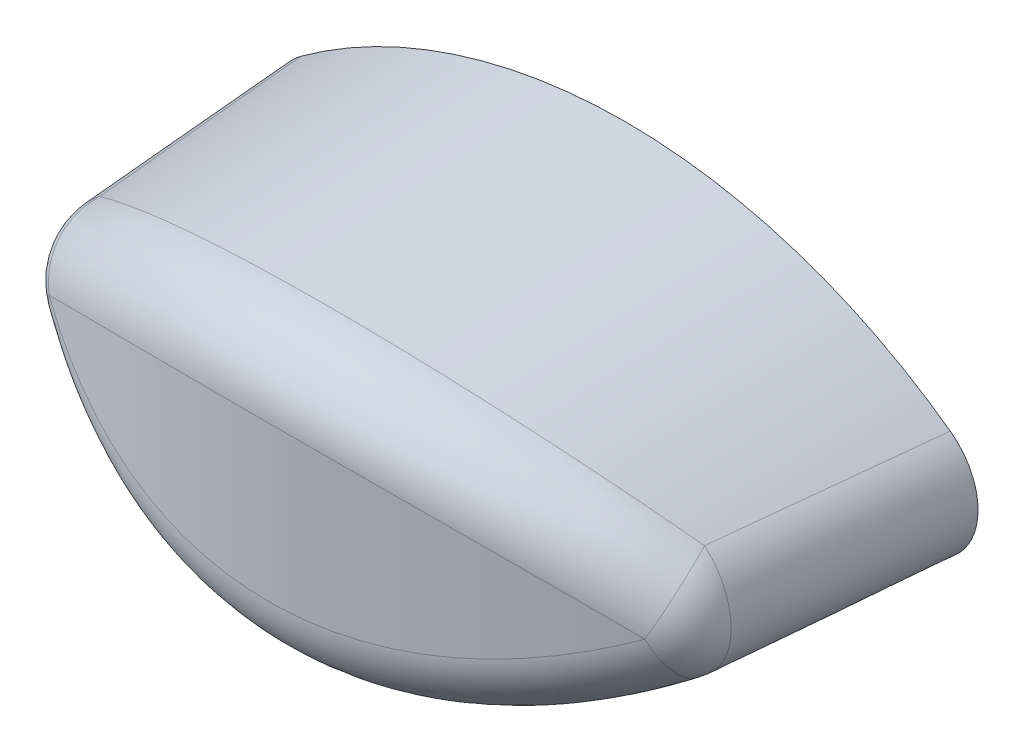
ISO-10303-21;
HEADER;
FILE_DESCRIPTION(('STEP AP214'),'2;1');
FILE_NAME('part.step','',(''),(''),'','','');
FILE_SCHEMA(('AUTOMOTIVE_DESIGN { 1 0 10303 214 1 1 1 1 }'));
ENDSEC;
DATA;
#1=APPLICATION_CONTEXT('core data for automotive mechanical design processes');
#2=APPLICATION_PROTOCOL_DEFINITION('international standard','automotive_design',2000,#1);
#3=PRODUCT_CONTEXT('',#1,'mechanical');
#4=PRODUCT('Part','Part','',(#3));
#5=PRODUCT_RELATED_PRODUCT_CATEGORY('part','',(#4));
#6=PRODUCT_DEFINITION_FORMATION('','',#4);
#7=PRODUCT_DEFINITION_CONTEXT('part definition',#1,'design');
#8=PRODUCT_DEFINITION('design','',#6,#7);
#9=PRODUCT_DEFINITION_SHAPE('','',#8);
#10=(LENGTH_UNIT() NAMED_UNIT(*) SI_UNIT(.MILLI.,.METRE.));
#11=(NAMED_UNIT(*) PLANE_ANGLE_UNIT() SI_UNIT($,.RADIAN.));
#12=(NAMED_UNIT(*) SI_UNIT($,.STERADIAN.) SOLID_ANGLE_UNIT());
#13=UNCERTAINTY_MEASURE_WITH_UNIT(LENGTH_MEASURE(1.E-05),#10,'distance_accuracy_value','');
#14=(GEOMETRIC_REPRESENTATION_CONTEXT(3) GLOBAL_UNCERTAINTY_ASSIGNED_CONTEXT((#13)) GLOBAL_UNIT_ASSIGNED_CONTEXT((#10,
#11,#12)) REPRESENTATION_CONTEXT('',''));
#15=CARTESIAN_POINT('',(0.,0.,0.));
#16=DIRECTION('',(0.,0.,1.));
#17=DIRECTION('',(1.,0.,0.));
#18=AXIS2_PLACEMENT_3D('',#15,#16,#17);
#19=CARTESIAN_POINT('',(0.00623951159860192,0.0207674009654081,0.4));
#20=DIRECTION('',(0.,0.,1.));
#21=DIRECTION('',(0.,1.,0.));
#22=AXIS2_PLACEMENT_3D('',#19,#20,#21);
#23=PLANE('',#22);
#24=CARTESIAN_POINT('',(0.00621037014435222,11.6806696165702,0.4));
#25=DIRECTION('',(0.,0.,1.));
#26=DIRECTION('',(0.,1.,0.));
#27=AXIS2_PLACEMENT_3D('',#24,#25,#26);
#28=CIRCLE('',#27,16.4098837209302);
#29=CARTESIAN_POINT('',(-9.63948865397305,-1.59505160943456,0.4));
#30=VERTEX_POINT('',#29);
#31=CARTESIAN_POINT('',(9.65197575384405,-1.59500339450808,0.4));
#32=VERTEX_POINT('',#31);
#33=EDGE_CURVE('E80',#30,#32,#28,.T.);
#34=ORIENTED_EDGE('',*,*,#33,.F.);
#35=CARTESIAN_POINT('',(-9.63948865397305,-1.59505160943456,0.4));
#36=CARTESIAN_POINT('',(-10.0277149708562,-1.31297923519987,0.4));
#37=CARTESIAN_POINT('',(-10.2456755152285,-0.886406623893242,0.4));
#38=CARTESIAN_POINT('',(-10.4636436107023,-0.459819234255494,0.4));
#39=CARTESIAN_POINT('',(-10.4641021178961,0.0188379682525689,0.4));
#40=CARTESIAN_POINT('',(-10.4645617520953,0.498671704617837,0.4));
#41=CARTESIAN_POINT('',(-10.2463995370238,0.926480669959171,0.4));
#42=CARTESIAN_POINT('',(-10.0283996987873,1.35397121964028,0.4));
#43=CARTESIAN_POINT('',(-9.63949673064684,1.6365381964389,0.4));
#44=B_SPLINE_CURVE_WITH_KNOTS('',2,(#35,#36,#37,#38,#39,#40,#41,#42,#43),.UNSPECIFIED.,.F.,.F.,
(3,2,2,2,3),(0.,0.25,0.5,0.75,1.),.UNSPECIFIED.);
#45=CARTESIAN_POINT('',(-9.63949673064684,1.6365381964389,0.4));
#46=VERTEX_POINT('',#45);
#47=EDGE_CURVE('E61',#30,#46,#44,.T.);
#48=ORIENTED_EDGE('',*,*,#47,.T.);
#49=CARTESIAN_POINT('',(0.00626865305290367,-11.6391348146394,0.4));
#50=DIRECTION('',(0.,0.,1.));
#51=DIRECTION('',(0.,1.,0.));
#52=AXIS2_PLACEMENT_3D('',#49,#50,#51);
#53=CIRCLE('',#52,16.4098837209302);
#54=CARTESIAN_POINT('',(9.65196767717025,1.63658641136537,0.4));
#55=VERTEX_POINT('',#54);
#56=EDGE_CURVE('E90',#55,#46,#53,.T.);
#57=ORIENTED_EDGE('',*,*,#56,.F.);
#58=CARTESIAN_POINT('',(9.65196767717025,1.63658641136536,0.4));
#59=CARTESIAN_POINT('',(10.0401939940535,1.35451403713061,0.4));
#60=CARTESIAN_POINT('',(10.2581545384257,0.927941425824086,0.4));
#61=CARTESIAN_POINT('',(10.4761226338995,0.501354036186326,0.4));
#62=CARTESIAN_POINT('',(10.4765811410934,0.0226968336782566,0.4));
#63=CARTESIAN_POINT('',(10.4770407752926,-0.457136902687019,0.4));
#64=CARTESIAN_POINT('',(10.2588785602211,-0.884945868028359,0.4));
#65=CARTESIAN_POINT('',(10.0408787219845,-1.31243641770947,0.4));
#66=CARTESIAN_POINT('',(9.65197575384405,-1.59500339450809,0.4));
#67=B_SPLINE_CURVE_WITH_KNOTS('',2,(#58,#59,#60,#61,#62,#63,#64,#65,#66),.UNSPECIFIED.,.F.,.F.,
(3,2,2,2,3),(0.,0.25,0.5,0.75,1.),.UNSPECIFIED.);
#68=EDGE_CURVE('E74',#55,#32,#67,.T.);
#69=ORIENTED_EDGE('',*,*,#68,.T.);
#70=EDGE_LOOP('',(#34,#48,#57,#69));
#71=FACE_BOUND('',#70,.T.);
#72=CARTESIAN_POINT('',(0.,0.,0.4));
#73=DIRECTION('',(0.,0.,1.));
#74=DIRECTION('',(1.,0.,0.));
#75=AXIS2_PLACEMENT_3D('',#72,#73,#74);
#76=CIRCLE('',#75,3.5);
#77=CARTESIAN_POINT('',(3.5,0.,0.4));
#78=VERTEX_POINT('',#77);
#79=EDGE_CURVE('E241',#78,#78,#76,.F.);
#80=ORIENTED_EDGE('',*,*,#79,.F.);
#81=EDGE_LOOP('',(#80));
#82=FACE_BOUND('',#81,.T.);
#83=ADVANCED_FACE('F14',(#71,#82),#23,.F.);
#84=CARTESIAN_POINT('',(0.00621037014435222,11.6806696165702,0.4));
#85=DIRECTION('',(0.,0.,-1.));
#86=DIRECTION('',(0.,1.,0.));
#87=AXIS2_PLACEMENT_3D('',#84,#85,#86);
#88=CONICAL_SURFACE('',#87,16.4098837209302,0.05235987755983);
#89=CARTESIAN_POINT('',(12.8358686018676,3.20842294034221,5.62536611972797));
#90=CARTESIAN_POINT('',(13.2938254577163,2.46774282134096,5.15999902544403));
#91=CARTESIAN_POINT('',(13.0135981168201,2.01735512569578,4.32721957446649));
#92=CARTESIAN_POINT('',(12.6832420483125,3.03793769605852,5.78046301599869));
#93=CARTESIAN_POINT('',(13.1507383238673,2.27528138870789,5.31670531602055));
#94=CARTESIAN_POINT('',(12.8596726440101,1.82229661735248,4.46508348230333));
#95=CARTESIAN_POINT('',(12.5259445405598,2.87015788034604,5.93467855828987));
#96=CARTESIAN_POINT('',(13.0033714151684,2.08590602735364,5.47250515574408));
#97=CARTESIAN_POINT('',(12.7009788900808,1.63028964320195,4.60216396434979));
#98=CARTESIAN_POINT('',(12.2018658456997,2.5401268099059,6.24068227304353));
#99=CARTESIAN_POINT('',(12.6988234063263,1.71187851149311,5.78291523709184));
#100=CARTESIAN_POINT('',(12.3739034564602,1.25252085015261,4.87416726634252));
#101=CARTESIAN_POINT('',(12.0350833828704,2.37787630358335,6.39247011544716));
#102=CARTESIAN_POINT('',(12.5415105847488,1.52720936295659,5.93756314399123));
#103=CARTESIAN_POINT('',(12.205520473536,1.06675987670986,5.00908979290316));
#104=CARTESIAN_POINT('',(11.5196060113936,1.89896325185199,6.84379197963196));
#105=CARTESIAN_POINT('',(12.0514517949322,0.977251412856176,6.4015030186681));
#106=CARTESIAN_POINT('',(11.6849138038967,0.51833524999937,5.41026478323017));
#107=CARTESIAN_POINT('',(11.1564502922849,1.5908892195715,7.13859711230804));
#108=CARTESIAN_POINT('',(11.7047263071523,0.621690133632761,6.70614549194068));
#109=CARTESIAN_POINT('',(11.3179071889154,0.16538811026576,5.67231379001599));
#110=CARTESIAN_POINT('',(10.3868375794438,0.996792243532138,7.71312372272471));
#111=CARTESIAN_POINT('',(10.9638101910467,-0.071439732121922,7.3063005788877));
#112=CARTESIAN_POINT('',(10.5396274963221,-0.515508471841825,6.18300411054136));
#113=CARTESIAN_POINT('',(9.97992005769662,0.711072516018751,7.99262607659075));
#114=CARTESIAN_POINT('',(10.5680917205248,-0.408448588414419,7.60153413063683));
#115=CARTESIAN_POINT('',(10.1278830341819,-0.8431136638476,6.43145064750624));
#116=CARTESIAN_POINT('',(9.12670511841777,0.169673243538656,8.5264066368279));
#117=CARTESIAN_POINT('',(9.72967194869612,-1.0553645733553,8.17273362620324));
#118=CARTESIAN_POINT('',(9.2640439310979,-1.46410286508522,6.90592225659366));
#119=CARTESIAN_POINT('',(8.68045267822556,-0.0860398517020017,8.78071296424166));
#120=CARTESIAN_POINT('',(9.28606107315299,-1.36474568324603,8.44832547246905));
#121=CARTESIAN_POINT('',(8.81199536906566,-1.75752509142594,7.131972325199));
#122=CARTESIAN_POINT('',(7.90032783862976,-0.485724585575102,9.18048316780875));
#123=CARTESIAN_POINT('',(8.50327407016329,-1.85399985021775,8.88667718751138));
#124=CARTESIAN_POINT('',(8.02134170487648,-2.21629407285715,7.48732361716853));
#125=CARTESIAN_POINT('',(7.5768679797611,-0.639063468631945,9.33452293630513));
#126=CARTESIAN_POINT('',(8.17486590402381,-2.04407137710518,9.05773061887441));
#127=CARTESIAN_POINT('',(7.69341271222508,-2.39234275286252,7.62424785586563));
#128=CARTESIAN_POINT('',(6.91312543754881,-0.928345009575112,9.62605790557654));
#129=CARTESIAN_POINT('',(7.49465937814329,-2.40648260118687,9.38494283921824));
#130=CARTESIAN_POINT('',(7.02030040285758,-2.72453179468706,7.88339005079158));
#131=CARTESIAN_POINT('',(6.57284768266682,-1.06429272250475,9.76355791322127));
#132=CARTESIAN_POINT('',(7.14283754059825,-2.57843715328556,9.54076857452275));
#133=CARTESIAN_POINT('',(6.67512214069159,-2.88067794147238,8.00561227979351));
#134=CARTESIAN_POINT('',(5.87861100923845,-1.31634755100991,10.0191349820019));
#135=CARTESIAN_POINT('',(6.41808363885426,-2.90071838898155,9.83357365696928));
#136=CARTESIAN_POINT('',(5.97070718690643,-3.17023033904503,8.23279189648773));
#137=CARTESIAN_POINT('',(5.52474253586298,-1.43256480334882,10.1373197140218));
#138=CARTESIAN_POINT('',(6.04542624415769,-3.05071493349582,9.97025844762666));
#139=CARTESIAN_POINT('',(5.61156328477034,-3.30376280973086,8.33784499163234));
#140=CARTESIAN_POINT('',(4.80330945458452,-1.64432630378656,10.3530811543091));
#141=CARTESIAN_POINT('',(5.27839922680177,-3.3269192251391,10.2224466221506));
#142=CARTESIAN_POINT('',(4.87921956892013,-3.54710819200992,8.52963293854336));
#143=CARTESIAN_POINT('',(4.43575278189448,-1.73988231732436,10.4506695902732));
#144=CARTESIAN_POINT('',(4.88445010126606,-3.4526373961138,10.3375087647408));
#145=CARTESIAN_POINT('',(4.50602789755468,-3.65693460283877,8.61637821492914));
#146=CARTESIAN_POINT('',(3.80394954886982,-1.88277653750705,10.5968076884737));
#147=CARTESIAN_POINT('',(4.20223112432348,-3.64217818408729,10.5112332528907));
#148=CARTESIAN_POINT('',(3.86443087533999,-3.82118622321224,8.7462787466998));
#149=CARTESIAN_POINT('',(3.5426870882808,-1.93590654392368,10.6512094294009));
#150=CARTESIAN_POINT('',(3.91830926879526,-3.71313151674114,10.5763464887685));
#151=CARTESIAN_POINT('',(3.59908846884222,-3.88226280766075,8.7946358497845));
#152=CARTESIAN_POINT('',(3.01522944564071,-2.03108402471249,10.7487409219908));
#153=CARTESIAN_POINT('',(3.34205213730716,-3.84096356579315,10.693750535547));
#154=CARTESIAN_POINT('',(3.06334386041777,-3.991682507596,8.88133050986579));
#155=CARTESIAN_POINT('',(2.74902926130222,-2.07311952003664,10.791858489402));
#156=CARTESIAN_POINT('',(3.05000541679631,-3.89767347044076,10.7458869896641));
#157=CARTESIAN_POINT('',(2.79293652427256,-4.04001185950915,8.91965723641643));
#158=CARTESIAN_POINT('',(2.1353413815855,-2.15611683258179,10.8770384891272));
#159=CARTESIAN_POINT('',(2.37332515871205,-4.01024751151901,10.8494400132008));
#160=CARTESIAN_POINT('',(2.16950533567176,-4.13544029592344,8.99537279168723));
#161=CARTESIAN_POINT('',(1.78663428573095,-2.19324375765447,10.9151806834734));
#162=CARTESIAN_POINT('',(1.98758659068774,-4.0607801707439,10.8959720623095));
#163=CARTESIAN_POINT('',(1.81522998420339,-4.1781315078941,9.02927696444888));
#164=CARTESIAN_POINT('',(1.08550481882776,-2.24761571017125,10.9710563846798));
#165=CARTESIAN_POINT('',(1.20878029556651,-4.13510965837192,10.9644382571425));
#166=CARTESIAN_POINT('',(1.10286681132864,-4.24065385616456,9.07894425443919));
#167=CARTESIAN_POINT('',(0.733081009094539,-2.2648527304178,10.9887816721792));
#168=CARTESIAN_POINT('',(0.816608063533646,-4.15872006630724,10.9862007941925));
#169=CARTESIAN_POINT('',(0.744777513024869,-4.2604757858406,9.09470006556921));
#170=CARTESIAN_POINT('',(0.0268819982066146,-2.27912368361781,11.0034561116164));
#171=CARTESIAN_POINT('',(0.0291670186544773,-4.17830879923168,11.0042554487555));
#172=CARTESIAN_POINT('',(0.0272158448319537,-4.27688677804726,9.10774401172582));
#173=CARTESIAN_POINT('',(-0.326894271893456,-2.27613505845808,11.0003820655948));
#174=CARTESIAN_POINT('',(-0.365137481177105,-4.17420817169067,11.0004747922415));
#175=CARTESIAN_POINT('',(-0.332257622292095,-4.27344989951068,9.1050115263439));
#176=CARTESIAN_POINT('',(-1.03266303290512,-2.24995545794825,10.9734650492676));
#177=CARTESIAN_POINT('',(-1.15157280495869,-4.13829892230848,10.9673812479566));
#178=CARTESIAN_POINT('',(-1.04937384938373,-4.24334472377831,9.08108528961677));
#179=CARTESIAN_POINT('',(-1.38465569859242,-2.22676650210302,10.9496241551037));
#180=CARTESIAN_POINT('',(-1.54274833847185,-4.10658069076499,10.9381516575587));
#181=CARTESIAN_POINT('',(-1.40701678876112,-4.21667874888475,9.05989338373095));
#182=CARTESIAN_POINT('',(-2.083505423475,-2.16067334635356,10.8817245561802));
#183=CARTESIAN_POINT('',(-2.31751086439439,-4.01641429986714,10.8551248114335));
#184=CARTESIAN_POINT('',(-2.11703919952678,-4.14068014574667,8.99953818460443));
#185=CARTESIAN_POINT('',(-2.43037217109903,-2.11781315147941,10.837710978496));
#186=CARTESIAN_POINT('',(-2.70024687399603,-3.95823462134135,10.8015744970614));
#187=CARTESIAN_POINT('',(-2.46942861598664,-4.09139811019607,8.96041500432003));
#188=CARTESIAN_POINT('',(-3.11740227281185,-2.01311073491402,10.7303115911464));
#189=CARTESIAN_POINT('',(-3.45502690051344,-3.81677085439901,10.6715171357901));
#190=CARTESIAN_POINT('',(-3.16732680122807,-3.97101869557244,8.86494888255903));
#191=CARTESIAN_POINT('',(-3.45756543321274,-1.95126796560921,10.6669252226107));
#192=CARTESIAN_POINT('',(-3.82635412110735,-3.73378463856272,10.5952831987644));
#193=CARTESIAN_POINT('',(-3.51283537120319,-3.89992068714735,8.80860544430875));
#194=CARTESIAN_POINT('',(-4.12889563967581,-1.80961145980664,10.521950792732));
#195=CARTESIAN_POINT('',(-4.55488016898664,-3.54489313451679,10.4220285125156));
#196=CARTESIAN_POINT('',(-4.19462182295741,-3.73708303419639,8.67973928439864));
#197=CARTESIAN_POINT('',(-4.46006831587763,-1.72980927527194,10.4403744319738));
#198=CARTESIAN_POINT('',(-4.91154696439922,-3.43935250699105,10.3253402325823));
#199=CARTESIAN_POINT('',(-4.53090548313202,-3.64535665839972,8.60722696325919));
#200=CARTESIAN_POINT('',(-5.11205713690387,-1.55331054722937,10.2602952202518));
#201=CARTESIAN_POINT('',(-5.60883281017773,-3.20767172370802,10.1135067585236));
#202=CARTESIAN_POINT('',(-5.19284369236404,-3.44251342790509,8.44715655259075));
#203=CARTESIAN_POINT('',(-5.43286923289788,-1.45660749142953,10.1617858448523));
#204=CARTESIAN_POINT('',(-5.949089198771,-3.0818857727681,9.99868201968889));
#205=CARTESIAN_POINT('',(-5.51849408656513,-3.33138909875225,8.35959266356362));
#206=CARTESIAN_POINT('',(-6.07409920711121,-1.24374468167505,9.94545409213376));
#207=CARTESIAN_POINT('',(-6.62388621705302,-2.80732142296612,9.74864462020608));
#208=CARTESIAN_POINT('',(-6.16926297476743,-3.08682165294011,8.16729777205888));
#209=CARTESIAN_POINT('',(-6.39408130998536,-1.12700673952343,9.82706110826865));
#210=CARTESIAN_POINT('',(-6.95769822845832,-2.6581968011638,9.61313064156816));
#211=CARTESIAN_POINT('',(-6.49393434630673,-2.95271555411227,8.06205956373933));
#212=CARTESIAN_POINT('',(-7.02031414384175,-0.878069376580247,9.57534310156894));
#213=CARTESIAN_POINT('',(-7.60565813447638,-2.34300101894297,9.32757323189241));
#214=CARTESIAN_POINT('',(-7.12919127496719,-2.66679543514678,7.83831022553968));
#215=CARTESIAN_POINT('',(-7.32655959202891,-0.745864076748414,9.44201240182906));
#216=CARTESIAN_POINT('',(-7.91974859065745,-2.17725951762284,9.1778190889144));
#217=CARTESIAN_POINT('',(-7.43977141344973,-2.51497468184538,7.71979404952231));
#218=CARTESIAN_POINT('',(-8.2246962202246,-0.327453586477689,9.0215243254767));
#219=CARTESIAN_POINT('',(-8.82797308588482,-1.66044719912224,8.7125337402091));
#220=CARTESIAN_POINT('',(-8.35037156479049,-2.03458435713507,7.34602687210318));
#221=CARTESIAN_POINT('',(-8.79488403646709,-0.0198269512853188,8.714252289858));
#222=CARTESIAN_POINT('',(-9.3986257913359,-1.2855176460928,8.37706247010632));
#223=CARTESIAN_POINT('',(-8.92813120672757,-1.68151556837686,7.07289617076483));
#224=CARTESIAN_POINT('',(-9.74972270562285,0.566487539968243,8.13468981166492));
#225=CARTESIAN_POINT('',(-10.343021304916,-0.579969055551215,7.75245667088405));
#226=CARTESIAN_POINT('',(-9.89502967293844,-1.00892742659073,6.55772952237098));
#227=CARTESIAN_POINT('',(-10.1469655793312,0.835677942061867,7.8704948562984));
#228=CARTESIAN_POINT('',(-10.7307801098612,-0.26105470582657,7.47215032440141));
#229=CARTESIAN_POINT('',(-10.2970696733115,-0.700231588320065,6.3228895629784));
#230=CARTESIAN_POINT('',(-10.9052205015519,1.39897291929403,7.3233801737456));
#231=CARTESIAN_POINT('',(-11.4635025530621,0.399042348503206,6.89807862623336));
#232=CARTESIAN_POINT('',(-11.0640531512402,-0.0545317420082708,5.83656540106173));
#233=CARTESIAN_POINT('',(-11.2662019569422,1.69309815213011,7.04044496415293));
#234=CARTESIAN_POINT('',(-11.809397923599,0.739996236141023,6.60440852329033));
#235=CARTESIAN_POINT('',(-11.4289653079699,0.282495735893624,5.58506743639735));
#236=CARTESIAN_POINT('',(-11.9496268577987,2.30156288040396,6.46316263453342));
#237=CARTESIAN_POINT('',(-12.4586338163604,1.43872968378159,6.01095233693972));
#238=CARTESIAN_POINT('',(-12.1194061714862,0.979413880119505,5.07192758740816));
#239=CARTESIAN_POINT('',(-12.272304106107,2.61575958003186,6.1689010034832));
#240=CARTESIAN_POINT('',(-12.763178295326,1.79634042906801,5.7111184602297));
#241=CARTESIAN_POINT('',(-12.4451739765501,1.3391428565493,4.81036169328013));
#242=CARTESIAN_POINT('',(-12.7295163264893,3.1020289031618,5.72189512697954));
#243=CARTESIAN_POINT('',(-13.1932233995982,2.3475286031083,5.25761808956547));
#244=CARTESIAN_POINT('',(-12.9064574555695,1.89563330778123,4.41302313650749));
#245=CARTESIAN_POINT('',(-12.8773478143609,3.26647975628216,5.57207711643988));
#246=CARTESIAN_POINT('',(-13.3313340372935,2.53250522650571,5.10678810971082));
#247=CARTESIAN_POINT('',(-13.0555511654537,2.0837923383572,4.27985157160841));
#248=CARTESIAN_POINT('',(-13.1642561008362,3.60040134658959,5.27118754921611));
#249=CARTESIAN_POINT('',(-13.5985503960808,2.90674898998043,4.80498605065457));
#250=CARTESIAN_POINT('',(-13.3448060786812,2.46576926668,4.01239417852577));
#251=CARTESIAN_POINT('',(-13.3033336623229,3.76987164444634,5.1201161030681));
#252=CARTESIAN_POINT('',(-13.7277683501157,3.09604549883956,4.65396519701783));
#253=CARTESIAN_POINT('',(-13.4849680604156,2.65958666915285,3.87810844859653));
#254=CARTESIAN_POINT('',(-13.4380835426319,3.94184593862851,4.96874935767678));
#255=CARTESIAN_POINT('',(-13.8530622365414,3.28820012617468,4.50261080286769));
#256=CARTESIAN_POINT('',(-13.6207181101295,2.85622356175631,3.74356023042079));
#257=(BOUNDED_SURFACE() B_SPLINE_SURFACE(3,2,((#89,#90,#91),(#92,#93,#94),(#95,#96,#97),(#98,
#99,#100),(#101,#102,#103),(#104,#105,#106),(#107,#108,#109),(#110,#111,#112),(#113,#114,#115),
(#116,#117,#118),(#119,#120,#121),(#122,#123,#124),(#125,#126,#127),(#128,#129,#130),(#131,#132,
#133),(#134,#135,#136),(#137,#138,#139),(#140,#141,#142),(#143,#144,#145),(#146,#147,#148),
(#149,#150,#151),(#152,#153,#154),(#155,#156,#157),(#158,#159,#160),(#161,#162,#163),(#164,#165,
#166),(#167,#168,#169),(#170,#171,#172),(#173,#174,#175),(#176,#177,#178),(#179,#180,#181),
(#182,#183,#184),(#185,#186,#187),(#188,#189,#190),(#191,#192,#193),(#194,#195,#196),(#197,#198,
#199),(#200,#201,#202),(#203,#204,#205),(#206,#207,#208),(#209,#210,#211),(#212,#213,#214),
(#215,#216,#217),(#218,#219,#220),(#221,#222,#223),(#224,#225,#226),(#227,#228,#229),(#230,#231,
#232),(#233,#234,#235),(#236,#237,#238),(#239,#240,#241),(#242,#243,#244),(#245,#246,#247),
(#248,#249,#250),(#251,#252,#253),(#254,#255,#256)),.UNSPECIFIED.,.F.,.F.,
.F.) B_SPLINE_SURFACE_WITH_KNOTS((4,2,2,2,2,2,2,2,2,2,2,2,2,2,2,2,2,2,2,2,2,2,2,2,2,2,2,4),(3,
3),(0.,0.773395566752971,1.54689540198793,3.09729176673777,4.6659890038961,6.23291523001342,
7.29235349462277,8.35148311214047,9.40449096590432,10.4568976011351,11.1857133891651,
11.9153129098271,12.8561618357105,13.7973893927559,14.7396668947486,15.68185020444,
16.6219360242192,17.5620489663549,18.5015589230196,19.4414316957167,20.4153715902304,
21.3896828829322,23.3415850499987,24.8466378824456,26.3529500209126,27.8495353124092,
28.5966586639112,29.3437168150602),(0.,1.),
.UNSPECIFIED.) GEOMETRIC_REPRESENTATION_ITEM() RATIONAL_B_SPLINE_SURFACE(((1.,0.896680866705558,
1.),(1.,0.893097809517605,1.),(1.,0.88943726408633,1.),(1.,0.881979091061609,1.),(1.,
0.878181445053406,1.),(1.,0.866594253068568,1.),(1.,0.858626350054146,1.),(1.,0.842331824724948,
1.),(1.,0.834002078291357,1.),(1.,0.81737121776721,1.),(1.,0.809070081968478,1.),(1.,
0.795498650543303,1.),(1.,0.790117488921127,1.),(1.,0.779683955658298,1.),(1.,0.774631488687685,
1.),(1.,0.765039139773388,1.),(1.,0.760496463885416,1.),(1.,0.752055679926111,1.),(1.,
0.748157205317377,1.),(1.,0.742238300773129,1.),(1.,0.74000898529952,1.),(1.,0.735980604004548,
1.),(1.,0.734182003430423,1.),(1.,0.730608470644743,1.),(1.,0.728991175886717,1.),(1.,
0.72661414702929,1.),(1.,0.72585475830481,1.),(1.,0.72522643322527,1.),(1.,0.72535849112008,1.),
(1.,0.7265097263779,1.),(1.,0.727528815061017,1.),(1.,0.730407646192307,1.),(1.,
0.732265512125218,1.),(1.,0.736746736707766,1.),(1.,0.739370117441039,1.),(1.,0.745282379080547,
1.),(1.,0.74857083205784,1.),(1.,0.755703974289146,1.),(1.,0.75954887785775,1.),(1.,
0.767825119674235,1.),(1.,0.772272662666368,1.),(1.,0.78151398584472,1.),(1.,0.786307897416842,
1.),(1.,0.801049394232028,1.),(1.,0.811341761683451,1.),(1.,0.829661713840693,1.),(1.,
0.837668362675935,1.),(1.,0.853489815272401,1.),(1.,0.8613044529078,1.),(1.,0.876479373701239,
1.),(1.,0.883842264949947,1.),(1.,0.894468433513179,1.),(1.,0.89793824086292,1.),(1.,
0.904726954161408,1.),(1.,0.908045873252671,1.),(1.,0.911282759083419,1.))) REPRESENTATION_ITEM('') SURFACE());
#258=CARTESIAN_POINT('',(13.0135981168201,2.01735512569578,4.32721957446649));
#259=CARTESIAN_POINT('',(12.8596726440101,1.82229661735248,4.46508348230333));
#260=CARTESIAN_POINT('',(12.7009788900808,1.63028964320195,4.60216396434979));
#261=CARTESIAN_POINT('',(12.3739034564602,1.25252085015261,4.87416726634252));
#262=CARTESIAN_POINT('',(12.205520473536,1.06675987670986,5.00908979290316));
#263=CARTESIAN_POINT('',(11.6849138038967,0.51833524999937,5.41026478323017));
#264=CARTESIAN_POINT('',(11.3179071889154,0.16538811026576,5.67231379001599));
#265=CARTESIAN_POINT('',(10.5396274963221,-0.515508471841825,6.18300411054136));
#266=CARTESIAN_POINT('',(10.1278830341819,-0.8431136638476,6.43145064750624));
#267=CARTESIAN_POINT('',(9.2640439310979,-1.46410286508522,6.90592225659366));
#268=CARTESIAN_POINT('',(8.81199536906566,-1.75752509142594,7.131972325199));
#269=CARTESIAN_POINT('',(8.02134170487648,-2.21629407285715,7.48732361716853));
#270=CARTESIAN_POINT('',(7.69341271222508,-2.39234275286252,7.62424785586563));
#271=CARTESIAN_POINT('',(7.02030040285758,-2.72453179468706,7.88339005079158));
#272=CARTESIAN_POINT('',(6.67512214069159,-2.88067794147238,8.00561227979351));
#273=CARTESIAN_POINT('',(5.97070718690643,-3.17023033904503,8.23279189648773));
#274=CARTESIAN_POINT('',(5.61156328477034,-3.30376280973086,8.33784499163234));
#275=CARTESIAN_POINT('',(4.87921956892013,-3.54710819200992,8.52963293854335));
#276=CARTESIAN_POINT('',(4.50602789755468,-3.65693460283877,8.61637821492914));
#277=CARTESIAN_POINT('',(3.86443087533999,-3.82118622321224,8.7462787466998));
#278=CARTESIAN_POINT('',(3.59908846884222,-3.88226280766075,8.79463584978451));
#279=CARTESIAN_POINT('',(3.06334386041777,-3.991682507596,8.88133050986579));
#280=CARTESIAN_POINT('',(2.79293652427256,-4.04001185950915,8.91965723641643));
#281=CARTESIAN_POINT('',(2.16950533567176,-4.13544029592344,8.99537279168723));
#282=CARTESIAN_POINT('',(1.81522998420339,-4.1781315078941,9.02927696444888));
#283=CARTESIAN_POINT('',(1.10286681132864,-4.24065385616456,9.07894425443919));
#284=CARTESIAN_POINT('',(0.744777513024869,-4.2604757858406,9.09470006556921));
#285=CARTESIAN_POINT('',(0.0272158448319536,-4.27688677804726,9.10774401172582));
#286=CARTESIAN_POINT('',(-0.332257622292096,-4.27344989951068,9.1050115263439));
#287=CARTESIAN_POINT('',(-1.04937384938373,-4.24334472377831,9.08108528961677));
#288=CARTESIAN_POINT('',(-1.40701678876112,-4.21667874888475,9.05989338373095));
#289=CARTESIAN_POINT('',(-2.11703919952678,-4.14068014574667,8.99953818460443));
#290=CARTESIAN_POINT('',(-2.46942861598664,-4.09139811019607,8.96041500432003));
#291=CARTESIAN_POINT('',(-3.16732680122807,-3.97101869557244,8.86494888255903));
#292=CARTESIAN_POINT('',(-3.51283537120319,-3.89992068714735,8.80860544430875));
#293=CARTESIAN_POINT('',(-4.19462182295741,-3.73708303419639,8.67973928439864));
#294=CARTESIAN_POINT('',(-4.53090548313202,-3.64535665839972,8.6072269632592));
#295=CARTESIAN_POINT('',(-5.19284369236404,-3.44251342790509,8.44715655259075));
#296=CARTESIAN_POINT('',(-5.51849408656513,-3.33138909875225,8.35959266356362));
#297=CARTESIAN_POINT('',(-6.16926297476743,-3.08682165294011,8.16729777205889));
#298=CARTESIAN_POINT('',(-6.49393434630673,-2.95271555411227,8.06205956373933));
#299=CARTESIAN_POINT('',(-7.12919127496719,-2.66679543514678,7.83831022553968));
#300=CARTESIAN_POINT('',(-7.43977141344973,-2.51497468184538,7.71979404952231));
#301=CARTESIAN_POINT('',(-8.35037156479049,-2.03458435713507,7.34602687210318));
#302=CARTESIAN_POINT('',(-8.92813120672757,-1.68151556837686,7.07289617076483));
#303=CARTESIAN_POINT('',(-9.89502967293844,-1.00892742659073,6.55772952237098));
#304=CARTESIAN_POINT('',(-10.2970696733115,-0.700231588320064,6.3228895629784));
#305=CARTESIAN_POINT('',(-11.0640531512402,-0.0545317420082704,5.83656540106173));
#306=CARTESIAN_POINT('',(-11.4289653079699,0.282495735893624,5.58506743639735));
#307=CARTESIAN_POINT('',(-12.1194061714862,0.979413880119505,5.07192758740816));
#308=CARTESIAN_POINT('',(-12.4451739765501,1.3391428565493,4.81036169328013));
#309=CARTESIAN_POINT('',(-12.9064574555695,1.89563330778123,4.41302313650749));
#310=CARTESIAN_POINT('',(-13.0555511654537,2.0837923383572,4.27985157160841));
#311=CARTESIAN_POINT('',(-13.3448060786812,2.46576926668,4.01239417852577));
#312=CARTESIAN_POINT('',(-13.4849680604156,2.65958666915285,3.87810844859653));
#313=CARTESIAN_POINT('',(-13.6207181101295,2.85622356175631,3.74356023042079));
#314=B_SPLINE_CURVE_WITH_KNOTS('',3,(#258,#259,#260,#261,#262,#263,#264,#265,#266,#267,#268,
#269,#270,#271,#272,#273,#274,#275,#276,#277,#278,#279,#280,#281,#282,#283,#284,#285,#286,#287,
#288,#289,#290,#291,#292,#293,#294,#295,#296,#297,#298,#299,#300,#301,#302,#303,#304,#305,#306,
#307,#308,#309,#310,#311,#312,#313),.UNSPECIFIED.,.F.,.F.,(4,2,2,2,2,2,2,2,2,2,2,2,2,2,2,2,2,2,
2,2,2,2,2,2,2,2,2,4),(0.,0.773395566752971,1.54689540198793,3.09729176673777,4.6659890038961,
6.23291523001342,7.29235349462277,8.35148311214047,9.40449096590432,10.4568976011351,
11.1857133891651,11.9153129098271,12.8561618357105,13.7973893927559,14.7396668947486,
15.68185020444,16.6219360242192,17.5620489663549,18.5015589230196,19.4414316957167,
20.4153715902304,21.3896828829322,23.3415850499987,24.8466378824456,26.3529500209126,
27.8495353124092,28.5966586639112,29.3437168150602),.UNSPECIFIED.);
#315=CARTESIAN_POINT('',(8.98851046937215,-1.6349703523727,7.03793435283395));
#316=VERTEX_POINT('',#315);
#317=CARTESIAN_POINT('',(-8.9760195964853,-1.63501546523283,7.0379690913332));
#318=VERTEX_POINT('',#317);
#319=EDGE_CURVE('E83',#316,#318,#314,.T.);
#320=ORIENTED_EDGE('',*,*,#319,.T.);
#321=CARTESIAN_POINT('',(-6.18088444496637,1.83582368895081,30.593285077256));
#322=CARTESIAN_POINT('',(-7.33189129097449,1.29899150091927,30.7378470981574));
#323=CARTESIAN_POINT('',(-7.33188809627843,0.0207490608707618,30.7378470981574));
#324=CARTESIAN_POINT('',(-7.33188490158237,-1.25749337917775,30.7378470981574));
#325=CARTESIAN_POINT('',(-6.18087537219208,-1.79431981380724,30.593285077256));
#326=CARTESIAN_POINT('',(-6.33941960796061,1.82752541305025,29.4740645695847));
#327=CARTESIAN_POINT('',(-7.47262149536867,1.28513116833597,29.6167366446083));
#328=CARTESIAN_POINT('',(-7.47303114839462,0.0207487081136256,29.6133297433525));
#329=CARTESIAN_POINT('',(-7.47261517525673,-1.24363375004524,29.6167366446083));
#330=CARTESIAN_POINT('',(-6.33941057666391,-1.78602233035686,29.4740645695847));
#331=CARTESIAN_POINT('',(-6.49271746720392,1.81933691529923,28.3543121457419));
#332=CARTESIAN_POINT('',(-7.60940118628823,1.27195694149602,28.4919819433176));
#333=CARTESIAN_POINT('',(-7.60976465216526,0.020748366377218,28.4888489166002));
#334=CARTESIAN_POINT('',(-7.60939493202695,-1.23046020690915,28.4919819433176));
#335=CARTESIAN_POINT('',(-6.49270847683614,-1.77783459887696,28.3543121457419));
#336=CARTESIAN_POINT('',(-6.79046179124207,1.80317271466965,26.1139587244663));
#337=CARTESIAN_POINT('',(-7.87543500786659,1.24685564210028,26.2431066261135));
#338=CARTESIAN_POINT('',(-7.87581267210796,0.0207477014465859,26.2399222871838));
#339=CARTESIAN_POINT('',(-7.87542887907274,-1.20536023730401,26.2431066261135));
#340=CARTESIAN_POINT('',(-6.79045288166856,-1.76167188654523,26.1139587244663));
#341=CARTESIAN_POINT('',(-6.93490837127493,1.79519700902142,24.9933577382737));
#342=CARTESIAN_POINT('',(-8.00480815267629,1.23491433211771,25.1183326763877));
#343=CARTESIAN_POINT('',(-8.00512728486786,0.0207473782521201,25.1154764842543));
#344=CARTESIAN_POINT('',(-8.00480208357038,-1.1934195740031,25.1183326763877));
#345=CARTESIAN_POINT('',(-6.93489950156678,-1.75369690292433,24.9933577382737));
#346=CARTESIAN_POINT('',(-7.21657147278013,1.77945174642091,22.7515404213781));
#347=CARTESIAN_POINT('',(-8.2574234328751,1.21205164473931,22.8694202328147));
#348=CARTESIAN_POINT('',(-8.25773592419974,0.0207467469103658,22.8665998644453));
#349=CARTESIAN_POINT('',(-8.25741747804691,-1.17055814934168,22.8694202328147));
#350=CARTESIAN_POINT('',(-7.21656268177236,-1.73795304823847,22.7515404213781));
#351=CARTESIAN_POINT('',(-7.35378829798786,1.77168218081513,21.6303241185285));
#352=CARTESIAN_POINT('',(-8.38075610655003,1.20111971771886,21.7447489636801));
#353=CARTESIAN_POINT('',(-8.38103020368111,0.0207464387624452,21.7421690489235));
#354=CARTESIAN_POINT('',(-8.38075020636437,-1.15962683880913,21.7447489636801));
#355=CARTESIAN_POINT('',(-7.35377954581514,-1.73018416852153,21.6303241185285));
#356=CARTESIAN_POINT('',(-7.62208806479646,1.75634181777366,19.38734932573));
#357=CARTESIAN_POINT('',(-8.622260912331,1.18011787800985,19.4958181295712));
#358=CARTESIAN_POINT('',(-8.6225335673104,0.0207458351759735,19.4932521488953));
#359=CARTESIAN_POINT('',(-8.62225511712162,-1.13862620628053,19.4958181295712));
#360=CARTESIAN_POINT('',(-7.62207938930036,-1.71484514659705,19.38734932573));
#361=CARTESIAN_POINT('',(-7.75317098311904,1.74877102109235,18.2655908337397));
#362=CARTESIAN_POINT('',(-8.7405047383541,1.17003984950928,18.3711078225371));
#363=CARTESIAN_POINT('',(-8.74074263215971,0.0207455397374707,18.3687660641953));
#364=CARTESIAN_POINT('',(-8.74049899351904,-1.12854876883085,18.3711078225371));
#365=CARTESIAN_POINT('',(-7.7531623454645,-1.70727500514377,18.2655908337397));
#366=CARTESIAN_POINT('',(-8.13855828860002,1.72634804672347,14.8999061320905));
#367=CARTESIAN_POINT('',(-9.08791175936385,1.14096910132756,15.0048377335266));
#368=CARTESIAN_POINT('',(-9.08887847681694,0.0207446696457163,14.9954610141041));
#369=CARTESIAN_POINT('',(-9.08790615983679,-1.09947975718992,15.0048377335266));
#370=CARTESIAN_POINT('',(-8.13854976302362,-1.68485395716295,14.8999061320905));
#371=CARTESIAN_POINT('',(-8.38503228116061,1.71178352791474,12.6553200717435));
#372=CARTESIAN_POINT('',(-9.31157067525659,1.12297830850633,12.7545451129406));
#373=CARTESIAN_POINT('',(-9.31234177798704,0.0207441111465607,12.7465438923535));
#374=CARTESIAN_POINT('',(-9.31156516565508,-1.08149008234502,12.7545451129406));
#375=CARTESIAN_POINT('',(-8.38502382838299,-1.67029067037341,12.6553200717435));
#376=CARTESIAN_POINT('',(-8.86211241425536,1.68336831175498,8.16488478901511));
#377=CARTESIAN_POINT('',(-9.74549798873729,1.08923658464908,8.25631567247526));
#378=CARTESIAN_POINT('',(-9.74625579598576,0.0207430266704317,8.24841148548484));
#379=CARTESIAN_POINT('',(-9.74549264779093,-1.04775052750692,8.25631567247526));
#380=CARTESIAN_POINT('',(-8.86210410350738,-1.64187783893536,8.16488478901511));
#381=CARTESIAN_POINT('',(-9.0927183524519,1.66951762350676,5.91903555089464));
#382=CARTESIAN_POINT('',(-9.95608149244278,1.07345274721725,6.00606910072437));
#383=CARTESIAN_POINT('',(-9.95670634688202,0.0207425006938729,5.99919619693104));
#384=CARTESIAN_POINT('',(-9.9560762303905,-1.03196774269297,6.00606910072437));
#385=CARTESIAN_POINT('',(-9.09271011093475,-1.62802830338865,5.91903555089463));
#386=CARTESIAN_POINT('',(-9.54133020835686,1.64248209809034,1.42662711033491));
#387=CARTESIAN_POINT('',(-10.3666996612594,1.04365279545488,1.50755386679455));
#388=CARTESIAN_POINT('',(-10.3673201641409,0.020741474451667,1.50072646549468));
#389=CARTESIAN_POINT('',(-10.3666945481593,-1.00216984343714,1.50755386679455));
#390=CARTESIAN_POINT('',(-9.54132210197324,-1.60099502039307,1.42662711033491));
#391=CARTESIAN_POINT('',(-9.75933734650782,1.62929719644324,-0.819932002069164));
#392=CARTESIAN_POINT('',(-10.5669635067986,1.02961388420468,-0.742526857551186));
#393=CARTESIAN_POINT('',(-10.5674844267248,0.0207409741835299,-0.748527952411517));
#394=CARTESIAN_POINT('',(-10.5669584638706,-0.988131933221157,-0.742526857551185));
#395=CARTESIAN_POINT('',(-9.75932930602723,-1.58781120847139,-0.819932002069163));
#396=CARTESIAN_POINT('',(-10.1851316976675,1.60354636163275,-5.31375728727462));
#397=CARTESIAN_POINT('',(-10.9589849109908,1.00296600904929,-5.24130546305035));
#398=CARTESIAN_POINT('',(-10.959500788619,0.0207399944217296,-5.24725960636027));
#399=CARTESIAN_POINT('',(-10.9589800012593,-0.96148601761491,-5.24130546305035));
#400=CARTESIAN_POINT('',(-10.1851237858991,-1.5620625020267,-5.31375728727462));
#401=CARTESIAN_POINT('',(-10.3929189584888,1.59098042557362,-7.5610234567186));
#402=CARTESIAN_POINT('',(-11.1509140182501,0.990340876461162,-7.49146271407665));
#403=CARTESIAN_POINT('',(-11.1513529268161,0.0207395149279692,-7.49673684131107));
#404=CARTESIAN_POINT('',(-11.1509091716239,-0.948861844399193,-7.49146271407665));
#405=CARTESIAN_POINT('',(-10.3929111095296,-1.54949760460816,-7.5610234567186));
#406=CARTESIAN_POINT('',(-10.800050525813,1.56642413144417,-12.0563700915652));
#407=CARTESIAN_POINT('',(-11.527772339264,0.966271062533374,-11.9908733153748));
#408=CARTESIAN_POINT('',(-11.5282118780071,0.0207385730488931,-11.9961443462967));
#409=CARTESIAN_POINT('',(-11.5277676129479,-0.924793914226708,-11.9908733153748));
#410=CARTESIAN_POINT('',(-10.8000427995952,-1.52494334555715,-12.0563700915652));
#411=CARTESIAN_POINT('',(-10.9993939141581,1.55443383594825,-14.3044506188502));
#412=CARTESIAN_POINT('',(-11.7128335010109,0.954814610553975,-14.2413251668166));
#413=CARTESIAN_POINT('',(-11.7132179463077,0.0207381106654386,-14.246074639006));
#414=CARTESIAN_POINT('',(-11.7128288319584,-0.913338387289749,-14.2413251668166));
#415=CARTESIAN_POINT('',(-10.9993862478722,-1.51295404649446,-14.3044506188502));
#416=CARTESIAN_POINT('',(-11.3908784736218,1.53099260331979,-18.8010843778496));
#417=CARTESIAN_POINT('',(-12.0770290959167,0.932902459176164,-18.7414955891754));
#418=CARTESIAN_POINT('',(-12.077399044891,0.0207372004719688,-18.7461247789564));
#419=CARTESIAN_POINT('',(-12.0770245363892,-0.891428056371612,-18.7414955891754));
#420=CARTESIAN_POINT('',(-11.3908709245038,-1.48951477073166,-18.8010843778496));
#421=CARTESIAN_POINT('',(-11.5830196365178,1.51954166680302,-21.0496376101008));
#422=CARTESIAN_POINT('',(-12.2562694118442,0.922437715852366,-20.9922216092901));
#423=CARTESIAN_POINT('',(-12.2565740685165,0.0207367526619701,-20.9962446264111));
#424=CARTESIAN_POINT('',(-12.2562649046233,-0.880964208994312,-20.9922216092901));
#425=CARTESIAN_POINT('',(-11.5830121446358,-1.47806479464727,-21.0496376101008));
#426=CARTESIAN_POINT('',(-11.7721917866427,1.50834158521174,-23.2983756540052));
#427=CARTESIAN_POINT('',(-12.4333536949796,0.912371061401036,-23.2464469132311));
#428=CARTESIAN_POINT('',(-12.4333514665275,0.0207363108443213,-23.2464469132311));
#429=CARTESIAN_POINT('',(-12.4333492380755,-0.870898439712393,-23.2464469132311));
#430=CARTESIAN_POINT('',(-11.7721843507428,-1.46686565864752,-23.2983756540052));
#431=(BOUNDED_SURFACE() B_SPLINE_SURFACE(3,2,((#321,#322,#323,#324,#325),(#326,#327,#328,#329,
#330),(#331,#332,#333,#334,#335),(#336,#337,#338,#339,#340),(#341,#342,#343,#344,#345),(#346,
#347,#348,#349,#350),(#351,#352,#353,#354,#355),(#356,#357,#358,#359,#360),(#361,#362,#363,#364,
#365),(#366,#367,#368,#369,#370),(#371,#372,#373,#374,#375),(#376,#377,#378,#379,#380),(#381,
#382,#383,#384,#385),(#386,#387,#388,#389,#390),(#391,#392,#393,#394,#395),(#396,#397,#398,#399,
#400),(#401,#402,#403,#404,#405),(#406,#407,#408,#409,#410),(#411,#412,#413,#414,#415),(#416,
#417,#418,#419,#420),(#421,#422,#423,#424,#425),(#426,#427,#428,#429,#430)),.UNSPECIFIED.,.F.,
.F.,.F.) B_SPLINE_SURFACE_WITH_KNOTS((4,2,2,2,2,2,2,2,2,2,4),(3,2,3),(0.,3.38398347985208,
6.76792289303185,10.1517200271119,13.5355300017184,20.3023934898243,27.0693432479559,
33.8356363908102,40.6018978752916,47.3688932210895,54.1358962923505),(0.,0.5,1.),
.UNSPECIFIED.) GEOMETRIC_REPRESENTATION_ITEM() RATIONAL_B_SPLINE_SURFACE(((1.,0.842607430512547,
1.,0.842607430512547,1.),(1.,0.845264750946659,1.,0.845264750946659,1.),(1.,0.847776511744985,
1.,0.847776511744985,1.),(1.,0.852552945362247,1.,0.852552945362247,1.),(1.,0.854817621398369,
1.,0.854817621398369,1.),(1.,0.859143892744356,1.,0.859143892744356,1.),(1.,0.86120549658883,1.,
0.86120549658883,1.),(1.,0.86515567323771,1.,0.86515567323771,1.),(1.,0.867044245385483,1.,
0.867044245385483,1.),(1.,0.872487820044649,1.,0.872487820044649,1.),(1.,0.875821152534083,1.,
0.875821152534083,1.),(1.,0.882036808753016,1.,0.882036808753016,1.),(1.,0.88491912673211,1.,
0.88491912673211,1.),(1.,0.8903256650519,1.,0.8903256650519,1.),(1.,0.892849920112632,1.,
0.892849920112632,1.),(1.,0.89760795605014,1.,0.89760795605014,1.),(1.,0.899841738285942,1.,
0.899841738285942,1.),(1.,0.904069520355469,1.,0.904069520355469,1.),(1.,0.906063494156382,1.,
0.906063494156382,1.),(1.,0.909847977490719,1.,0.909847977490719,1.),(1.,0.911638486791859,1.,
0.911638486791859,1.),(1.,0.913345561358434,1.,0.913345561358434,1.))) REPRESENTATION_ITEM('') SURFACE());
#432=CARTESIAN_POINT('',(-6.18087537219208,-1.79431981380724,30.593285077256));
#433=CARTESIAN_POINT('',(-6.3394105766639,-1.78602233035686,29.4740645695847));
#434=CARTESIAN_POINT('',(-6.49270847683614,-1.77783459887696,28.3543121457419));
#435=CARTESIAN_POINT('',(-6.79045288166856,-1.76167188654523,26.1139587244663));
#436=CARTESIAN_POINT('',(-6.93489950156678,-1.75369690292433,24.9933577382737));
#437=CARTESIAN_POINT('',(-7.21656268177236,-1.73795304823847,22.7515404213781));
#438=CARTESIAN_POINT('',(-7.35377954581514,-1.73018416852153,21.6303241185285));
#439=CARTESIAN_POINT('',(-7.62207938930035,-1.71484514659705,19.38734932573));
#440=CARTESIAN_POINT('',(-7.7531623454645,-1.70727500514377,18.2655908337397));
#441=CARTESIAN_POINT('',(-8.13854976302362,-1.68485395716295,14.8999061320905));
#442=CARTESIAN_POINT('',(-8.38502382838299,-1.67029067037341,12.6553200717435));
#443=CARTESIAN_POINT('',(-8.86210410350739,-1.64187783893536,8.16488478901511));
#444=CARTESIAN_POINT('',(-9.09271011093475,-1.62802830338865,5.91903555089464));
#445=CARTESIAN_POINT('',(-9.54132210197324,-1.60099502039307,1.42662711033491));
#446=CARTESIAN_POINT('',(-9.75932930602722,-1.58781120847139,-0.819932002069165));
#447=CARTESIAN_POINT('',(-10.1851237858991,-1.5620625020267,-5.31375728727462));
#448=CARTESIAN_POINT('',(-10.3929111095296,-1.54949760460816,-7.5610234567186));
#449=CARTESIAN_POINT('',(-10.8000427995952,-1.52494334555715,-12.0563700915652));
#450=CARTESIAN_POINT('',(-10.9993862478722,-1.51295404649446,-14.3044506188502));
#451=CARTESIAN_POINT('',(-11.3908709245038,-1.48951477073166,-18.8010843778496));
#452=CARTESIAN_POINT('',(-11.5830121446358,-1.47806479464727,-21.0496376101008));
#453=CARTESIAN_POINT('',(-11.7721843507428,-1.46686565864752,-23.2983756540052));
#454=B_SPLINE_CURVE_WITH_KNOTS('',3,(#432,#433,#434,#435,#436,#437,#438,#439,#440,#441,#442,
#443,#444,#445,#446,#447,#448,#449,#450,#451,#452,#453),.UNSPECIFIED.,.F.,.F.,(4,2,2,2,2,2,2,2,
2,2,4),(0.,3.38398347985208,6.76792289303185,10.1517200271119,13.5355300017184,20.3023934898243,
27.0693432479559,33.8356363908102,40.6018978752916,47.3688932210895,54.1358962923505),.UNSPECIFIED.);
#455=EDGE_CURVE('E66',#318,#30,#454,.T.);
#456=ORIENTED_EDGE('',*,*,#455,.T.);
#457=ORIENTED_EDGE('',*,*,#33,.T.);
#458=CARTESIAN_POINT('',(6.19336651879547,-1.79428872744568,30.593263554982));
#459=CARTESIAN_POINT('',(7.34437303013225,-1.25745643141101,30.737825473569));
#460=CARTESIAN_POINT('',(7.34436983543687,0.0207857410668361,30.737825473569));
#461=CARTESIAN_POINT('',(7.34436664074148,1.29902791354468,30.737825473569));
#462=CARTESIAN_POINT('',(6.193357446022,1.83585445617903,30.593263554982));
#463=CARTESIAN_POINT('',(6.35190162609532,-1.78599045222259,29.4740429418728));
#464=CARTESIAN_POINT('',(7.48510318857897,-1.24359610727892,29.6167149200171));
#465=CARTESIAN_POINT('',(7.48551284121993,0.020786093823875,29.6133080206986));
#466=CARTESIAN_POINT('',(7.48509686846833,1.28516829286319,29.6167149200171));
#467=CARTESIAN_POINT('',(6.35189259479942,1.82755697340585,29.4740429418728));
#468=CARTESIAN_POINT('',(6.50519943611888,-1.7778019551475,28.3542904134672));
#469=CARTESIAN_POINT('',(7.62188283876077,-1.23042188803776,28.4919601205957));
#470=CARTESIAN_POINT('',(7.62224630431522,0.0207864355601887,28.4888270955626));
#471=CARTESIAN_POINT('',(7.62187658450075,1.2719947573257,28.4919601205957));
#472=CARTESIAN_POINT('',(6.50519044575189,1.81936924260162,28.3542904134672));
#473=CARTESIAN_POINT('',(6.8029436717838,-1.76163775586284,26.113936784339));
#474=CARTESIAN_POINT('',(7.88791658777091,-1.20532060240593,26.2430846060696));
#475=CARTESIAN_POINT('',(7.88829425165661,0.0207871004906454,26.2399002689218));
#476=CARTESIAN_POINT('',(7.88791045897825,1.24689480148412,26.2430846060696));
#477=CARTESIAN_POINT('',(6.80293476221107,1.80320653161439,26.113936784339));
#478=CARTESIAN_POINT('',(6.94739021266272,-1.75366205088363,24.9933356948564));
#479=CARTESIAN_POINT('',(8.01728970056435,-1.19337929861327,25.1183105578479));
#480=CARTESIAN_POINT('',(8.01760883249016,0.0207874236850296,25.1154543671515));
#481=CARTESIAN_POINT('',(8.01728363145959,1.23495414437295,25.1183105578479));
#482=CARTESIAN_POINT('',(6.94738134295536,1.79523154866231,24.9933356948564));
#483=CARTESIAN_POINT('',(7.2290532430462,-1.73791678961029,22.7515181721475));
#484=CARTESIAN_POINT('',(8.26990492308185,-1.17051662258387,22.8693979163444));
#485=CARTESIAN_POINT('',(8.27021741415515,0.0207880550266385,22.8665775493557));
#486=CARTESIAN_POINT('',(8.26989896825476,1.21209273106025,22.8693979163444));
#487=CARTESIAN_POINT('',(7.2290444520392,1.77948769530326,22.7515181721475));
#488=CARTESIAN_POINT('',(7.36627003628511,-1.73014722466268,21.6303017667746));
#489=CARTESIAN_POINT('',(8.39323757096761,-1.15958470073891,21.7447265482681));
#490=CARTESIAN_POINT('',(8.3935116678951,0.0207883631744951,21.7421466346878));
#491=CARTESIAN_POINT('',(8.39323167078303,1.20116142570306,21.7447265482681));
#492=CARTESIAN_POINT('',(7.36626128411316,1.77171881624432,21.6303017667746));
#493=CARTESIAN_POINT('',(7.63456974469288,-1.71480686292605,19.3873267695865));
#494=CARTESIAN_POINT('',(8.63474233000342,-1.13858287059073,19.4957955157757));
#495=CARTESIAN_POINT('',(8.63501498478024,0.0207889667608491,19.4932295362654));
#496=CARTESIAN_POINT('',(8.63473653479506,1.18016080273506,19.4957955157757));
#497=CARTESIAN_POINT('',(7.63456106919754,1.7563797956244,19.3873267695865));
#498=CARTESIAN_POINT('',(7.76565263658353,-1.70723606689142,18.26556817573));
#499=CARTESIAN_POINT('',(8.75298613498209,-1.12850484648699,18.3710851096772));
#500=CARTESIAN_POINT('',(8.7532240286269,0.0207892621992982,18.3687433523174));
#501=CARTESIAN_POINT('',(8.75298039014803,1.1700833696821,18.3710851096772));
#502=CARTESIAN_POINT('',(7.76564399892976,1.74880965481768,18.26556817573));
#503=CARTESIAN_POINT('',(8.15103986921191,-1.68481309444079,14.8998831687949));
#504=CARTESIAN_POINT('',(9.10039309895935,-1.0994341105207,15.0048147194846));
#505=CARTESIAN_POINT('',(9.10135981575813,0.0207901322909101,14.9954380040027));
#506=CARTESIAN_POINT('',(9.10038749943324,1.14101437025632,15.0048147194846));
#507=CARTESIAN_POINT('',(8.15103134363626,1.72638860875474,14.8998831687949));
#508=CARTESIAN_POINT('',(8.39751382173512,-1.67024857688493,12.6552969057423));
#509=CARTESIAN_POINT('',(9.32405198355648,-1.0814433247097,12.7545219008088));
#510=CARTESIAN_POINT('',(9.32482308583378,0.0207906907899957,12.7465206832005));
#511=CARTESIAN_POINT('',(9.32404647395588,1.12302470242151,12.7545219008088));
#512=CARTESIAN_POINT('',(8.39750536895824,1.71182532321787,12.6552969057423));
#513=CARTESIAN_POINT('',(8.87459388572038,-1.64183336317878,8.16486121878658));
#514=CARTESIAN_POINT('',(9.75797924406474,-1.04770161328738,8.25629206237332));
#515=CARTESIAN_POINT('',(9.75873705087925,0.0207917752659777,8.24838787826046));
#516=CARTESIAN_POINT('',(9.75797390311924,1.08928516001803,8.25629206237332));
#517=CARTESIAN_POINT('',(8.87458557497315,1.68341249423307,8.16486121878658));
#518=CARTESIAN_POINT('',(9.10519979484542,-1.62798267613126,5.91901177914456));
#519=CARTESIAN_POINT('',(9.96856272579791,-1.03191778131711,6.00604529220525));
#520=CARTESIAN_POINT('',(9.96918757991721,0.0207923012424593,5.99917239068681));
#521=CARTESIAN_POINT('',(9.96855746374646,1.0735023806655,6.00604529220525));
#522=CARTESIAN_POINT('',(9.10519155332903,1.66956295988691,5.91901177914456));
#523=CARTESIAN_POINT('',(9.55381160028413,-1.60094715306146,1.42660293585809));
#524=CARTESIAN_POINT('',(10.3791808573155,-1.0021178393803,1.50752965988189));
#525=CARTESIAN_POINT('',(10.3798013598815,0.0207933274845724,1.50070226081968));
#526=CARTESIAN_POINT('',(10.3791757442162,1.04370449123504,1.50752965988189));
#527=CARTESIAN_POINT('',(9.55380349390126,1.64252967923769,1.4266029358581));
#528=CARTESIAN_POINT('',(9.77181871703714,-1.58776225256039,-0.819956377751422));
#529=CARTESIAN_POINT('',(10.5794446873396,-0.988078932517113,-0.742551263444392));
#530=CARTESIAN_POINT('',(10.5799656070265,0.0207938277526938,-0.748552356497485));
#531=CARTESIAN_POINT('',(10.5794396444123,1.02966658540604,-0.742551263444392));
#532=CARTESIAN_POINT('',(9.77181067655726,1.62934586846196,-0.819956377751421));
#533=CARTESIAN_POINT('',(10.1976130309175,-1.56201141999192,-5.31378206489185));
#534=CARTESIAN_POINT('',(10.9714660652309,-0.961431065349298,-5.24133026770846));
#535=CARTESIAN_POINT('',(10.971981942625,0.0207948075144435,-5.24728440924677));
#536=CARTESIAN_POINT('',(10.9714611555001,1.00302067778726,-5.24133026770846));
#537=CARTESIAN_POINT('',(10.1976051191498,1.60359716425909,-5.31378206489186));
#538=CARTESIAN_POINT('',(10.4054002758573,-1.54944548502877,-7.56104843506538));
#539=CARTESIAN_POINT('',(11.1633951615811,-0.948805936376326,-7.49148771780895));
#540=CARTESIAN_POINT('',(11.1638340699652,0.020795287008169,-7.49676184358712));
#541=CARTESIAN_POINT('',(11.1633903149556,0.990396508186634,-7.49148771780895));
#542=CARTESIAN_POINT('',(10.4053924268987,1.59103226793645,-7.56104843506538));
#543=CARTESIAN_POINT('',(10.8125318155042,-1.52488919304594,-12.0563954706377));
#544=CARTESIAN_POINT('',(11.5402534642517,-0.924736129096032,-11.9908987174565));
#545=CARTESIAN_POINT('',(11.5406930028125,0.0207962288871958,-11.9961697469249));
#546=CARTESIAN_POINT('',(11.5402487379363,0.966328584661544,-11.9908987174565));
#547=CARTESIAN_POINT('',(10.8125240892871,1.56647801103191,-12.0563954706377));
#548=CARTESIAN_POINT('',(11.0118751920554,-1.51289889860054,-14.3044761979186));
#549=CARTESIAN_POINT('',(11.7253146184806,-0.913279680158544,-14.2413507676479));
#550=CARTESIAN_POINT('',(11.7256990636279,0.0207966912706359,-14.2461002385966));
#551=CARTESIAN_POINT('',(11.7253099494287,0.954873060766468,-14.2413507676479));
#552=CARTESIAN_POINT('',(11.0118675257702,1.5544887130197,-14.3044761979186));
#553=CARTESIAN_POINT('',(11.4033597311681,-1.48945766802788,-18.8011103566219));
#554=CARTESIAN_POINT('',(12.0895102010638,-0.891367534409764,-18.7415215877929));
#555=CARTESIAN_POINT('',(12.0898801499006,0.0207976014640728,-18.7461507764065));
#556=CARTESIAN_POINT('',(12.089505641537,0.932962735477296,-18.7415215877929));
#557=CARTESIAN_POINT('',(11.4033521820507,1.5310494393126,-18.8011103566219));
#558=CARTESIAN_POINT('',(11.595500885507,-1.4780067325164,-21.049663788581));
#559=CARTESIAN_POINT('',(12.2687505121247,-0.880902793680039,-20.99224780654));
#560=CARTESIAN_POINT('',(12.2690551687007,0.0207980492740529,-20.9962708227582));
#561=CARTESIAN_POINT('',(12.2687460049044,0.92249889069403,-20.99224780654));
#562=CARTESIAN_POINT('',(11.5954933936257,1.51959946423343,-21.049663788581));
#563=CARTESIAN_POINT('',(11.7846730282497,-1.46680665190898,-23.2984020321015));
#564=CARTESIAN_POINT('',(12.4458347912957,-0.870836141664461,-23.2464733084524));
#565=CARTESIAN_POINT('',(12.445832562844,0.0207984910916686,-23.2464733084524));
#566=CARTESIAN_POINT('',(12.4458303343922,0.912433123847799,-23.2464733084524));
#567=CARTESIAN_POINT('',(11.7846655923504,1.5084003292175,-23.2984020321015));
#568=(BOUNDED_SURFACE() B_SPLINE_SURFACE(3,2,((#458,#459,#460,#461,#462),(#463,#464,#465,#466,
#467),(#468,#469,#470,#471,#472),(#473,#474,#475,#476,#477),(#478,#479,#480,#481,#482),(#483,
#484,#485,#486,#487),(#488,#489,#490,#491,#492),(#493,#494,#495,#496,#497),(#498,#499,#500,#501,
#502),(#503,#504,#505,#506,#507),(#508,#509,#510,#511,#512),(#513,#514,#515,#516,#517),(#518,
#519,#520,#521,#522),(#523,#524,#525,#526,#527),(#528,#529,#530,#531,#532),(#533,#534,#535,#536,
#537),(#538,#539,#540,#541,#542),(#543,#544,#545,#546,#547),(#548,#549,#550,#551,#552),(#553,
#554,#555,#556,#557),(#558,#559,#560,#561,#562),(#563,#564,#565,#566,#567)),.UNSPECIFIED.,.F.,
.F.,.F.) B_SPLINE_SURFACE_WITH_KNOTS((4,2,2,2,2,2,2,2,2,2,4),(3,2,3),(0.,3.38398377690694,
6.76792348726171,10.1517209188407,13.535531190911,20.3023952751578,27.0693456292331,
33.835639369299,40.6019014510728,47.368897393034,54.1359010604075),(0.,0.5,1.),
.UNSPECIFIED.) GEOMETRIC_REPRESENTATION_ITEM() RATIONAL_B_SPLINE_SURFACE(((1.,0.842607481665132,
1.,0.842607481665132,1.),(1.,0.845264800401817,1.,0.845264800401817,1.),(1.,0.847776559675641,
1.,0.847776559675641,1.),(1.,0.85255299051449,1.,0.85255299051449,1.),(1.,0.854817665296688,1.,
0.854817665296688,1.),(1.,0.859143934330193,1.,0.859143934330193,1.),(1.,0.86120553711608,1.,
0.86120553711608,1.),(1.,0.865155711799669,1.,0.865155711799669,1.),(1.,0.867044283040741,1.,
0.867044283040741,1.),(1.,0.872487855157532,1.,0.872487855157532,1.),(1.,0.875821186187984,1.,
0.875821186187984,1.),(1.,0.882036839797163,1.,0.882036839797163,1.),(1.,0.884919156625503,1.,
0.884919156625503,1.),(1.,0.890325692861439,1.,0.890325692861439,1.),(1.,0.892849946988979,1.,
0.892849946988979,1.),(1.,0.89760798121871,1.,0.89760798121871,1.),(1.,0.899841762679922,1.,
0.899841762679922,1.),(1.,0.904069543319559,1.,0.904069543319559,1.),(1.,0.906063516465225,1.,
0.906063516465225,1.),(1.,0.909847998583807,1.,0.909847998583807,1.),(1.,0.911638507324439,1.,
0.911638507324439,1.),(1.,0.913345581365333,1.,0.913345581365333,1.))) REPRESENTATION_ITEM('') SURFACE());
#569=CARTESIAN_POINT('',(11.7846730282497,-1.46680665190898,-23.2984020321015));
#570=CARTESIAN_POINT('',(11.595500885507,-1.4780067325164,-21.049663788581));
#571=CARTESIAN_POINT('',(11.4033597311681,-1.48945766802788,-18.8011103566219));
#572=CARTESIAN_POINT('',(11.0118751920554,-1.51289889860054,-14.3044761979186));
#573=CARTESIAN_POINT('',(10.8125318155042,-1.52488919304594,-12.0563954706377));
#574=CARTESIAN_POINT('',(10.4054002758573,-1.54944548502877,-7.56104843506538));
#575=CARTESIAN_POINT('',(10.1976130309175,-1.56201141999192,-5.31378206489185));
#576=CARTESIAN_POINT('',(9.77181871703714,-1.58776225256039,-0.819956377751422));
#577=CARTESIAN_POINT('',(9.55381160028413,-1.60094715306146,1.42660293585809));
#578=CARTESIAN_POINT('',(9.10519979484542,-1.62798267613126,5.91901177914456));
#579=CARTESIAN_POINT('',(8.87459388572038,-1.64183336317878,8.16486121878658));
#580=CARTESIAN_POINT('',(8.39751382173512,-1.67024857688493,12.6552969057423));
#581=CARTESIAN_POINT('',(8.15103986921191,-1.68481309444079,14.899883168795));
#582=CARTESIAN_POINT('',(7.76565263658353,-1.70723606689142,18.26556817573));
#583=CARTESIAN_POINT('',(7.63456974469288,-1.71480686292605,19.3873267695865));
#584=CARTESIAN_POINT('',(7.36627003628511,-1.73014722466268,21.6303017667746));
#585=CARTESIAN_POINT('',(7.2290532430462,-1.73791678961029,22.7515181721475));
#586=CARTESIAN_POINT('',(6.94739021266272,-1.75366205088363,24.9933356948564));
#587=CARTESIAN_POINT('',(6.8029436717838,-1.76163775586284,26.113936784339));
#588=CARTESIAN_POINT('',(6.50519943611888,-1.7778019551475,28.3542904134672));
#589=CARTESIAN_POINT('',(6.35190162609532,-1.78599045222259,29.4740429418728));
#590=CARTESIAN_POINT('',(6.19336651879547,-1.79428872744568,30.593263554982));
#591=B_SPLINE_CURVE_WITH_KNOTS('',3,(#569,#570,#571,#572,#573,#574,#575,#576,#577,#578,#579,
#580,#581,#582,#583,#584,#585,#586,#587,#588,#589,#590),.UNSPECIFIED.,.F.,.F.,(4,2,2,2,2,2,2,2,
2,2,4),(0.,6.76700366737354,13.5339996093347,20.3002616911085,27.0665554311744,33.8335057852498,
40.6003698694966,43.9841801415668,47.3679775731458,50.7519172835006,54.1359010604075),.UNSPECIFIED.);
#592=EDGE_CURVE('E85',#32,#316,#591,.T.);
#593=ORIENTED_EDGE('',*,*,#592,.T.);
#594=EDGE_LOOP('',(#320,#456,#457,#593));
#595=FACE_BOUND('',#594,.T.);
#596=ADVANCED_FACE('F79',(#595),#88,.T.);
#597=CARTESIAN_POINT('',(0.00626865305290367,-11.6391348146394,0.4));
#598=DIRECTION('',(0.,0.,-1.));
#599=DIRECTION('',(0.,1.,0.));
#600=AXIS2_PLACEMENT_3D('',#597,#598,#599);
#601=CONICAL_SURFACE('',#600,16.4098837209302,0.05235987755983);
#602=ORIENTED_EDGE('',*,*,#56,.T.);
#603=CARTESIAN_POINT('',(-11.7721917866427,1.50834158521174,-23.2983756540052));
#604=CARTESIAN_POINT('',(-11.5830196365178,1.51954166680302,-21.0496376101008));
#605=CARTESIAN_POINT('',(-11.3908784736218,1.53099260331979,-18.8010843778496));
#606=CARTESIAN_POINT('',(-10.9993939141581,1.55443383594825,-14.3044506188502));
#607=CARTESIAN_POINT('',(-10.800050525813,1.56642413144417,-12.0563700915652));
#608=CARTESIAN_POINT('',(-10.3929189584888,1.59098042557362,-7.5610234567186));
#609=CARTESIAN_POINT('',(-10.1851316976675,1.60354636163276,-5.31375728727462));
#610=CARTESIAN_POINT('',(-9.75933734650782,1.62929719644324,-0.819932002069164));
#611=CARTESIAN_POINT('',(-9.54133020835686,1.64248209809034,1.42662711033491));
#612=CARTESIAN_POINT('',(-9.09271835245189,1.66951762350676,5.91903555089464));
#613=CARTESIAN_POINT('',(-8.86211241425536,1.68336831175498,8.16488478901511));
#614=CARTESIAN_POINT('',(-8.38503228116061,1.71178352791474,12.6553200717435));
#615=CARTESIAN_POINT('',(-8.13855828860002,1.72634804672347,14.8999061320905));
#616=CARTESIAN_POINT('',(-7.75317098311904,1.74877102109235,18.2655908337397));
#617=CARTESIAN_POINT('',(-7.62208806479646,1.75634181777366,19.38734932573));
#618=CARTESIAN_POINT('',(-7.35378829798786,1.77168218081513,21.6303241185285));
#619=CARTESIAN_POINT('',(-7.21657147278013,1.77945174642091,22.7515404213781));
#620=CARTESIAN_POINT('',(-6.93490837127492,1.79519700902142,24.9933577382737));
#621=CARTESIAN_POINT('',(-6.79046179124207,1.80317271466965,26.1139587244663));
#622=CARTESIAN_POINT('',(-6.49271746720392,1.81933691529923,28.3543121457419));
#623=CARTESIAN_POINT('',(-6.33941960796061,1.82752541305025,29.4740645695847));
#624=CARTESIAN_POINT('',(-6.18088444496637,1.83582368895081,30.593285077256));
#625=B_SPLINE_CURVE_WITH_KNOTS('',3,(#603,#604,#605,#606,#607,#608,#609,#610,#611,#612,#613,
#614,#615,#616,#617,#618,#619,#620,#621,#622,#623,#624),.UNSPECIFIED.,.F.,.F.,(4,2,2,2,2,2,2,2,
2,2,4),(0.,6.76700307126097,13.5339984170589,20.3002599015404,27.0665530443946,33.8335028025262,
40.6003662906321,43.9841762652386,47.3679733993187,50.7519128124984,54.1358962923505),.UNSPECIFIED.);
#626=CARTESIAN_POINT('',(-8.97602787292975,1.67650536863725,7.0379690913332));
#627=VERTEX_POINT('',#626);
#628=EDGE_CURVE('E67',#46,#627,#625,.T.);
#629=ORIENTED_EDGE('',*,*,#628,.T.);
#630=CARTESIAN_POINT('',(-12.8234821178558,-3.16700486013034,5.62533130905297));
#631=CARTESIAN_POINT('',(-13.2814383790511,-2.42633770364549,5.15996229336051));
#632=CARTESIAN_POINT('',(-13.0012201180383,-1.97595359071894,4.32718863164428));
#633=CARTESIAN_POINT('',(-12.6708600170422,-2.99652088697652,5.7804245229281));
#634=CARTESIAN_POINT('',(-13.1383555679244,-2.23387802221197,5.31666472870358));
#635=CARTESIAN_POINT('',(-12.8472991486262,-1.78089655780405,4.46504926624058));
#636=CARTESIAN_POINT('',(-12.5135671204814,-2.82874227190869,5.93463652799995));
#637=CARTESIAN_POINT('',(-12.9909931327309,-2.04450433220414,5.4724608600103));
#638=CARTESIAN_POINT('',(-12.6886100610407,-1.58889097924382,4.60212660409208));
#639=CARTESIAN_POINT('',(-12.1894979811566,-2.49871343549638,6.24063347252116));
#640=CARTESIAN_POINT('',(-12.6864544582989,-1.6704800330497,5.78286376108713));
#641=CARTESIAN_POINT('',(-12.3615443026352,-1.21112478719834,4.87412388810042));
#642=CARTESIAN_POINT('',(-12.0227204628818,-2.33646396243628,6.39241808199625));
#643=CARTESIAN_POINT('',(-12.5291465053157,-1.48581242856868,5.9375081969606));
#644=CARTESIAN_POINT('',(-12.1931663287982,-1.02536501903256,5.0090435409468));
#645=CARTESIAN_POINT('',(-11.5072585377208,-1.8575537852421,6.8437306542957));
#646=CARTESIAN_POINT('',(-12.0391031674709,-0.93585904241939,6.40143785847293));
#647=CARTESIAN_POINT('',(-11.6725753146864,-0.476943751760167,5.41021027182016));
#648=CARTESIAN_POINT('',(-11.1441138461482,-1.54948128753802,7.13853022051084));
#649=CARTESIAN_POINT('',(-11.6923888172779,-0.580300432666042,6.70607409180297));
#650=CARTESIAN_POINT('',(-11.3055798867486,-0.123998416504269,5.67225433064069));
#651=CARTESIAN_POINT('',(-10.374524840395,-0.955386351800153,7.71304711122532));
#652=CARTESIAN_POINT('',(-10.9514971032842,0.112824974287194,7.30621781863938));
#653=CARTESIAN_POINT('',(-10.5273242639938,0.55689573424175,6.1829360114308));
#654=CARTESIAN_POINT('',(-9.96762002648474,-0.669667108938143,7.99254533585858));
#655=CARTESIAN_POINT('',(-10.5557919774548,0.449832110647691,7.60144631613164));
#656=CARTESIAN_POINT('',(-10.1155927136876,0.884500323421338,6.43137887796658));
#657=CARTESIAN_POINT('',(-9.11443183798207,-0.128267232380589,8.52631959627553));
#658=CARTESIAN_POINT('',(-9.717400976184,1.09674624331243,8.17263745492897));
#659=CARTESIAN_POINT('',(-9.25178080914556,1.50549012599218,6.90584488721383));
#660=CARTESIAN_POINT('',(-8.66819343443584,0.127446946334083,8.78062374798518));
#661=CARTESIAN_POINT('',(-9.27380553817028,1.40612729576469,8.44822606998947));
#662=CARTESIAN_POINT('',(-8.79974652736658,1.79891355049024,7.13189302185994));
#663=CARTESIAN_POINT('',(-7.88808554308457,0.527138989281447,9.1803960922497));
#664=CARTESIAN_POINT('',(-8.49103840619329,1.89538804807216,8.88657862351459));
#665=CARTESIAN_POINT('',(-8.00911014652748,2.25769085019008,7.48724621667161));
#666=CARTESIAN_POINT('',(-7.56462787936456,0.680483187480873,9.33443920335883));
#667=CARTESIAN_POINT('',(-8.16263375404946,2.08546518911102,9.05763514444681));
#668=CARTESIAN_POINT('',(-7.68118342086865,2.43374560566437,7.62417342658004));
#669=CARTESIAN_POINT('',(-6.90088932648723,0.969775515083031,9.62598119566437));
#670=CARTESIAN_POINT('',(-7.48243403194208,2.44788803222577,9.38485406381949));
#671=CARTESIAN_POINT('',(-7.00807523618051,2.76594698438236,7.88332186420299));
#672=CARTESIAN_POINT('',(-6.56061336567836,1.10572869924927,9.76348488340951));
#673=CARTESIAN_POINT('',(-7.13061544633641,2.61984860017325,9.54068342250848));
#674=CARTESIAN_POINT('',(-6.66289883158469,2.92209939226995,8.00554736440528));
#675=CARTESIAN_POINT('',(-5.86637970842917,1.35779461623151,10.0190696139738));
#676=CARTESIAN_POINT('',(-6.40586756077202,2.94214231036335,9.83349629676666));
#677=CARTESIAN_POINT('',(-5.95848700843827,3.21166448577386,8.23273379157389));
#678=CARTESIAN_POINT('',(-5.51251245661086,1.47401748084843,10.137258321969));
#679=CARTESIAN_POINT('',(-6.03321288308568,3.09214531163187,9.97018525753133));
#680=CARTESIAN_POINT('',(-5.59934437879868,3.3452033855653,8.33779042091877));
#681=CARTESIAN_POINT('',(-4.79108124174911,1.68579031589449,10.3530279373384));
#682=CARTESIAN_POINT('',(-5.26619069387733,3.36836295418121,10.222382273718));
#683=CARTESIAN_POINT('',(-4.86700261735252,3.58856175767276,8.52958563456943));
#684=CARTESIAN_POINT('',(-4.4235252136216,1.78135205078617,10.4506205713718));
#685=CARTESIAN_POINT('',(-4.87224362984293,3.49408801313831,10.3374490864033));
#686=CARTESIAN_POINT('',(-4.49381162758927,3.69839472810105,8.61633464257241));
#687=CARTESIAN_POINT('',(-3.79168217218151,1.92426512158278,10.59677521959));
#688=CARTESIAN_POINT('',(-4.18998356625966,3.6836529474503,10.5111929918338));
#689=CARTESIAN_POINT('',(-3.85217422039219,3.86266799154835,8.74624988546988));
#690=CARTESIAN_POINT('',(-3.53037858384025,1.9774065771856,10.6511875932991));
#691=CARTESIAN_POINT('',(-3.9060176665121,3.75462127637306,10.5763189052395));
#692=CARTESIAN_POINT('',(-3.58679005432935,3.92375772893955,8.79461643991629));
#693=CARTESIAN_POINT('',(-3.00283698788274,2.07260342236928,10.7487367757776));
#694=CARTESIAN_POINT('',(-3.32966953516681,3.88247892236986,10.6937443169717));
#695=CARTESIAN_POINT('',(-3.05096018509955,4.0331996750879,8.88132682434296));
#696=CARTESIAN_POINT('',(-2.73659397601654,2.11464682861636,10.7918613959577));
#697=CARTESIAN_POINT('',(-3.03757599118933,3.93919934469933,10.7458893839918));
#698=CARTESIAN_POINT('',(-2.78050934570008,4.08153811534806,8.91965982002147));
#699=CARTESIAN_POINT('',(-2.12286241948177,2.19765042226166,10.8770454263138));
#700=CARTESIAN_POINT('',(-2.36084765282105,4.05178161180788,10.8494475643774));
#701=CARTESIAN_POINT('',(-2.15703378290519,4.17697375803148,8.99537895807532));
#702=CARTESIAN_POINT('',(-1.77415508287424,2.23477757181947,10.9151864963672));
#703=CARTESIAN_POINT('',(-1.97510874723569,4.10231442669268,10.8959784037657));
#704=CARTESIAN_POINT('',(-1.80275818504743,4.21966521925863,9.02928213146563));
#705=CARTESIAN_POINT('',(-1.07302518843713,2.28914994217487,10.9710599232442));
#706=CARTESIAN_POINT('',(-1.19630186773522,4.17664417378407,10.9644421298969));
#707=CARTESIAN_POINT('',(-1.09039457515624,4.28218803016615,9.07894739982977));
#708=CARTESIAN_POINT('',(-0.720601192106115,2.30638715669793,10.9887840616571));
#709=CARTESIAN_POINT('',(-0.804129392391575,4.20025468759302,10.9862034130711));
#710=CARTESIAN_POINT('',(-0.73230508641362,4.302010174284,9.09470218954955));
#711=CARTESIAN_POINT('',(-0.01440192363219,2.32065847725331,11.0034561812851));
#712=CARTESIAN_POINT('',(-0.0166880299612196,4.21984359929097,11.0042555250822));
#713=CARTESIAN_POINT('',(-0.0147431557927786,4.31842157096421,9.10774407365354));
#714=CARTESIAN_POINT('',(0.339374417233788,2.31767002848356,11.0003809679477));
#715=CARTESIAN_POINT('',(0.377616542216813,4.21574305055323,11.0004735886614));
#716=CARTESIAN_POINT('',(0.344730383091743,4.31498488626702,9.10501055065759));
#717=CARTESIAN_POINT('',(1.04514326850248,2.2914907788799,10.9734616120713));
#718=CARTESIAN_POINT('',(1.1640519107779,4.17983395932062,10.9673774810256));
#719=CARTESIAN_POINT('',(1.06184670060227,4.28488009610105,9.08108223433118));
#720=CARTESIAN_POINT('',(1.39713595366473,2.26830199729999,10.9496195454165));
#721=CARTESIAN_POINT('',(1.55522741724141,4.14811580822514,10.9381466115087));
#722=CARTESIAN_POINT('',(1.41948965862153,4.25821431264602,9.05988928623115));
#723=CARTESIAN_POINT('',(2.09598567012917,2.20220919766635,10.8817176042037));
#724=CARTESIAN_POINT('',(2.32998979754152,4.05794959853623,10.8551172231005));
#725=CARTESIAN_POINT('',(2.12951205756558,4.18221610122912,8.99953200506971));
#726=CARTESIAN_POINT('',(2.44285238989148,2.15934918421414,10.8377028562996));
#727=CARTESIAN_POINT('',(2.71272569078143,3.9997700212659,10.8015656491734));
#728=CARTESIAN_POINT('',(2.48190144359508,4.13293426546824,8.96040778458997));
#729=CARTESIAN_POINT('',(3.12988238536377,2.05464714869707,10.7303011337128));
#730=CARTESIAN_POINT('',(3.46750539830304,3.85830649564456,10.6715057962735));
#731=CARTESIAN_POINT('',(3.17979951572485,4.01255527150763,8.86493958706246));
#732=CARTESIAN_POINT('',(3.47004546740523,1.99280457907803,10.6669136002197));
#733=CARTESIAN_POINT('',(3.83883241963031,3.7753204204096,10.5952706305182));
#734=CARTESIAN_POINT('',(3.52530800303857,3.94145748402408,8.80859511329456));
#735=CARTESIAN_POINT('',(4.14137549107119,1.85114849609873,10.5219368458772));
#736=CARTESIAN_POINT('',(4.56735802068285,3.58642924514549,10.4220135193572));
#737=CARTESIAN_POINT('',(4.20709426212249,3.7786203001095,8.67972688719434));
#738=CARTESIAN_POINT('',(4.47254806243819,1.77134653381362,10.4403593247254));
#739=CARTESIAN_POINT('',(4.92402457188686,3.48088880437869,10.3253240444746));
#740=CARTESIAN_POINT('',(4.54337781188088,3.68689417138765,8.60721353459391));
#741=CARTESIAN_POINT('',(5.12453663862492,1.59484828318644,10.2602777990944));
#742=CARTESIAN_POINT('',(5.62130988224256,3.2492084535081,10.1134882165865));
#743=CARTESIAN_POINT('',(5.20531576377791,3.48405147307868,8.44714106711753));
#744=CARTESIAN_POINT('',(5.44534859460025,1.49814548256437,10.1617672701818));
#745=CARTESIAN_POINT('',(5.96156598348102,3.1234227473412,9.99866232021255));
#746=CARTESIAN_POINT('',(5.5309660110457,3.37292742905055,8.35957615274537));
#747=CARTESIAN_POINT('',(6.08657846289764,1.28528316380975,9.94543310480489));
#748=CARTESIAN_POINT('',(6.63636260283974,2.84885887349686,9.7486225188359));
#749=CARTESIAN_POINT('',(6.1817347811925,3.12836053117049,8.16727911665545));
#750=CARTESIAN_POINT('',(6.40656059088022,1.16854544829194,9.82703885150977));
#751=CARTESIAN_POINT('',(6.97017449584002,2.69973447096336,9.6131072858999));
#752=CARTESIAN_POINT('',(6.50640617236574,2.99425468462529,8.06203977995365));
#753=CARTESIAN_POINT('',(7.03279343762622,0.919608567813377,9.57531828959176));
#754=CARTESIAN_POINT('',(7.61813412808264,2.38453917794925,9.32754737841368));
#755=CARTESIAN_POINT('',(7.14166310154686,2.70833510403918,7.83828817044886));
#756=CARTESIAN_POINT('',(7.33903887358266,0.787403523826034,9.44198630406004));
#757=CARTESIAN_POINT('',(7.93222443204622,2.21879794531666,9.17779199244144));
#758=CARTESIAN_POINT('',(7.45224322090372,2.55651463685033,7.71977085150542));
#759=CARTESIAN_POINT('',(8.23717541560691,0.368993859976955,9.02149433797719));
#760=CARTESIAN_POINT('',(8.84044842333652,1.70198652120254,8.71250294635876));
#761=CARTESIAN_POINT('',(8.36284326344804,2.07612523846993,7.34600021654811));
#762=CARTESIAN_POINT('',(8.80736311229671,0.061367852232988,8.714219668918));
#763=CARTESIAN_POINT('',(9.41110076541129,1.32705766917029,8.37702919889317));
#764=CARTESIAN_POINT('',(8.94060276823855,1.7230571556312,7.07286717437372));
#765=CARTESIAN_POINT('',(9.76220247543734,-0.524945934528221,8.13465182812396));
#766=CARTESIAN_POINT('',(10.3554965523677,0.621509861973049,7.75241832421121));
#767=CARTESIAN_POINT('',(9.90750190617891,1.05046979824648,6.55769575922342));
#768=CARTESIAN_POINT('',(10.1594460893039,-0.794136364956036,7.87045411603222));
#769=CARTESIAN_POINT('',(10.7432559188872,0.302595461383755,7.47210935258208));
#770=CARTESIAN_POINT('',(10.3095426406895,0.741773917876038,6.32285334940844));
#771=CARTESIAN_POINT('',(10.9177023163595,-1.35743135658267,7.3233337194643));
#772=CARTESIAN_POINT('',(11.4759793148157,-0.357501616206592,6.8980322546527));
#773=CARTESIAN_POINT('',(11.0765274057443,0.0960740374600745,5.83652410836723));
#774=CARTESIAN_POINT('',(11.2786843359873,-1.651556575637,7.04039555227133));
#775=CARTESIAN_POINT('',(11.8218750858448,-0.698455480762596,6.60435937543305));
#776=CARTESIAN_POINT('',(11.4414401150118,-0.240953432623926,5.5850235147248));
#777=CARTESIAN_POINT('',(11.9621102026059,-2.26002117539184,6.46310711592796));
#778=CARTESIAN_POINT('',(12.4711116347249,-1.39718874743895,6.01089748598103));
#779=CARTESIAN_POINT('',(12.1318819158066,-0.93787144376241,5.07187823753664));
#780=CARTESIAN_POINT('',(12.2847878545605,-2.57421776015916,6.16884233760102));
#781=CARTESIAN_POINT('',(12.7756563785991,-1.75479934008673,5.71106068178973));
#782=CARTESIAN_POINT('',(12.4576501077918,-1.29760029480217,4.81030954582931));
#783=CARTESIAN_POINT('',(12.7420005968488,-3.06048680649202,5.72183154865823));
#784=CARTESIAN_POINT('',(13.2057018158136,-2.3059871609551,5.25755573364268));
#785=CARTESIAN_POINT('',(12.918934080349,-1.85409043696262,4.4129666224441));
#786=CARTESIAN_POINT('',(12.8898322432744,-3.22493754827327,5.57201187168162));
#787=CARTESIAN_POINT('',(13.3438125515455,-2.49096364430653,5.10672420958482));
#788=CARTESIAN_POINT('',(13.0680279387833,-2.0422493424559,4.27979357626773));
#789=CARTESIAN_POINT('',(13.1767408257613,-3.5588588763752,5.27111889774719));
#790=CARTESIAN_POINT('',(13.6110290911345,-2.86520708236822,4.80491899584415));
#791=CARTESIAN_POINT('',(13.3572831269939,-2.42422597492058,4.01233315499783));
#792=CARTESIAN_POINT('',(13.315818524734,-3.72832902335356,5.12004571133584));
#793=CARTESIAN_POINT('',(13.7402471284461,-3.05450340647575,4.65389653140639));
#794=CARTESIAN_POINT('',(13.4974452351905,-2.61804320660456,3.87804587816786));
#795=CARTESIAN_POINT('',(13.4505685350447,-3.90030314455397,4.96867718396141));
#796=CARTESIAN_POINT('',(13.8655410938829,-3.24665782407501,4.50254048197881));
#797=CARTESIAN_POINT('',(13.6331954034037,-2.81467990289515,3.74349607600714));
#798=(BOUNDED_SURFACE() B_SPLINE_SURFACE(3,2,((#630,#631,#632),(#633,#634,#635),(#636,#637,
#638),(#639,#640,#641),(#642,#643,#644),(#645,#646,#647),(#648,#649,#650),(#651,#652,#653),
(#654,#655,#656),(#657,#658,#659),(#660,#661,#662),(#663,#664,#665),(#666,#667,#668),(#669,#670,
#671),(#672,#673,#674),(#675,#676,#677),(#678,#679,#680),(#681,#682,#683),(#684,#685,#686),
(#687,#688,#689),(#690,#691,#692),(#693,#694,#695),(#696,#697,#698),(#699,#700,#701),(#702,#703,
#704),(#705,#706,#707),(#708,#709,#710),(#711,#712,#713),(#714,#715,#716),(#717,#718,#719),
(#720,#721,#722),(#723,#724,#725),(#726,#727,#728),(#729,#730,#731),(#732,#733,#734),(#735,#736,
#737),(#738,#739,#740),(#741,#742,#743),(#744,#745,#746),(#747,#748,#749),(#750,#751,#752),
(#753,#754,#755),(#756,#757,#758),(#759,#760,#761),(#762,#763,#764),(#765,#766,#767),(#768,#769,
#770),(#771,#772,#773),(#774,#775,#776),(#777,#778,#779),(#780,#781,#782),(#783,#784,#785),
(#786,#787,#788),(#789,#790,#791),(#792,#793,#794),(#795,#796,#797)),.UNSPECIFIED.,.F.,.F.,
.F.) B_SPLINE_SURFACE_WITH_KNOTS((4,2,2,2,2,2,2,2,2,2,2,2,2,2,2,2,2,2,2,2,2,2,2,2,2,2,2,4),(3,
3),(0.,0.773381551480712,1.54686735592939,3.09723525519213,4.6659032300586,6.23280041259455,
7.29224429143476,8.35137953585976,9.40439321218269,10.4568057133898,11.1857391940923,
11.9154565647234,12.8563059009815,13.79753382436,14.7398115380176,15.6819950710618,
16.6220811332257,17.5621943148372,18.5017045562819,19.4415776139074,20.4155184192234,
21.3898306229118,23.3417346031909,24.8467922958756,26.3531093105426,27.8496993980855,
28.596825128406,29.3438856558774),(0.,1.),
.UNSPECIFIED.) GEOMETRIC_REPRESENTATION_ITEM() RATIONAL_B_SPLINE_SURFACE(((1.,0.896682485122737,
1.),(1.,0.893099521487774,1.),(1.,0.88943907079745,1.),(1.,0.881981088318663,1.),(1.,
0.878183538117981,1.),(1.,0.866596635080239,1.),(1.,0.858628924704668,1.),(1.,0.84233476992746,
1.),(1.,0.834005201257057,1.),(1.,0.817374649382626,1.),(1.,0.809073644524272,1.),(1.,
0.795502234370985,1.),(1.,0.790120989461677,1.),(1.,0.779687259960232,1.),(1.,0.774634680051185,
1.),(1.,0.765042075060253,1.),(1.,0.760499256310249,1.),(1.,0.7520581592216,1.),(1.,
0.748159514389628,1.),(1.,0.742239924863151,1.),(1.,0.740010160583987,1.),(1.,0.735981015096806,
1.),(1.,0.734182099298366,1.),(1.,0.730608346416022,1.),(1.,0.728991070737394,1.),(1.,
0.726614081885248,1.),(1.,0.725854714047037,1.),(1.,0.725226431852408,1.),(1.,0.725358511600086,
1.),(1.,0.726509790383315,1.),(1.,0.727528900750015,1.),(1.,0.730407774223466,1.),(1.,
0.732265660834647,1.),(1.,0.736746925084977,1.),(1.,0.739370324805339,1.),(1.,0.745282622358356,
1.),(1.,0.748571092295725,1.),(1.,0.755704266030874,1.),(1.,0.759549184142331,1.),(1.,
0.767825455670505,1.),(1.,0.772273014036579,1.),(1.,0.781514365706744,1.),(1.,0.786308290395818,
1.),(1.,0.80104982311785,1.),(1.,0.811342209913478,1.),(1.,0.829662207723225,1.),(1.,
0.837668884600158,1.),(1.,0.853490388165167,1.),(1.,0.861305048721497,1.),(1.,0.876480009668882,
1.),(1.,0.883842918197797,1.),(1.,0.894469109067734,1.),(1.,0.897938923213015,1.),(1.,
0.904727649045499,1.),(1.,0.908046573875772,1.),(1.,0.911283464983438,1.))) REPRESENTATION_ITEM('') SURFACE());
#799=CARTESIAN_POINT('',(-13.0012201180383,-1.97595359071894,4.32718863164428));
#800=CARTESIAN_POINT('',(-12.8472991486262,-1.78089655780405,4.46504926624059));
#801=CARTESIAN_POINT('',(-12.6886100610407,-1.58889097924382,4.60212660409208));
#802=CARTESIAN_POINT('',(-12.3615443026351,-1.21112478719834,4.87412388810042));
#803=CARTESIAN_POINT('',(-12.1931663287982,-1.02536501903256,5.0090435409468));
#804=CARTESIAN_POINT('',(-11.6725753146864,-0.476943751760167,5.41021027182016));
#805=CARTESIAN_POINT('',(-11.3055798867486,-0.12399841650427,5.67225433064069));
#806=CARTESIAN_POINT('',(-10.5273242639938,0.55689573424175,6.1829360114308));
#807=CARTESIAN_POINT('',(-10.1155927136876,0.884500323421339,6.43137887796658));
#808=CARTESIAN_POINT('',(-9.25178080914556,1.50549012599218,6.90584488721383));
#809=CARTESIAN_POINT('',(-8.79974652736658,1.79891355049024,7.13189302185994));
#810=CARTESIAN_POINT('',(-8.00911014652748,2.25769085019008,7.48724621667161));
#811=CARTESIAN_POINT('',(-7.68118342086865,2.43374560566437,7.62417342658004));
#812=CARTESIAN_POINT('',(-7.00807523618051,2.76594698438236,7.88332186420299));
#813=CARTESIAN_POINT('',(-6.66289883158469,2.92209939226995,8.00554736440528));
#814=CARTESIAN_POINT('',(-5.95848700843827,3.21166448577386,8.23273379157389));
#815=CARTESIAN_POINT('',(-5.59934437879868,3.3452033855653,8.33779042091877));
#816=CARTESIAN_POINT('',(-4.86700261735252,3.58856175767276,8.52958563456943));
#817=CARTESIAN_POINT('',(-4.49381162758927,3.69839472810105,8.61633464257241));
#818=CARTESIAN_POINT('',(-3.85217422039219,3.86266799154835,8.74624988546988));
#819=CARTESIAN_POINT('',(-3.58679005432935,3.92375772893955,8.79461643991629));
#820=CARTESIAN_POINT('',(-3.05096018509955,4.0331996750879,8.88132682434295));
#821=CARTESIAN_POINT('',(-2.78050934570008,4.08153811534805,8.91965982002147));
#822=CARTESIAN_POINT('',(-2.15703378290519,4.17697375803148,8.99537895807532));
#823=CARTESIAN_POINT('',(-1.80275818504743,4.21966521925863,9.02928213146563));
#824=CARTESIAN_POINT('',(-1.09039457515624,4.28218803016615,9.07894739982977));
#825=CARTESIAN_POINT('',(-0.732305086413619,4.302010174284,9.09470218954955));
#826=CARTESIAN_POINT('',(-0.0147431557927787,4.31842157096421,9.10774407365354));
#827=CARTESIAN_POINT('',(0.344730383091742,4.31498488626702,9.10501055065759));
#828=CARTESIAN_POINT('',(1.06184670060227,4.28488009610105,9.08108223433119));
#829=CARTESIAN_POINT('',(1.41948965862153,4.25821431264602,9.05988928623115));
#830=CARTESIAN_POINT('',(2.12951205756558,4.18221610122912,8.99953200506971));
#831=CARTESIAN_POINT('',(2.48190144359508,4.13293426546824,8.96040778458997));
#832=CARTESIAN_POINT('',(3.17979951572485,4.01255527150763,8.86493958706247));
#833=CARTESIAN_POINT('',(3.52530800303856,3.94145748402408,8.80859511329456));
#834=CARTESIAN_POINT('',(4.20709426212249,3.7786203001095,8.67972688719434));
#835=CARTESIAN_POINT('',(4.54337781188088,3.68689417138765,8.6072135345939));
#836=CARTESIAN_POINT('',(5.20531576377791,3.48405147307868,8.44714106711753));
#837=CARTESIAN_POINT('',(5.5309660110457,3.37292742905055,8.35957615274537));
#838=CARTESIAN_POINT('',(6.1817347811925,3.12836053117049,8.16727911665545));
#839=CARTESIAN_POINT('',(6.50640617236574,2.99425468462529,8.06203977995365));
#840=CARTESIAN_POINT('',(7.14166310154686,2.70833510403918,7.83828817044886));
#841=CARTESIAN_POINT('',(7.45224322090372,2.55651463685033,7.71977085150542));
#842=CARTESIAN_POINT('',(8.36284326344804,2.07612523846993,7.34600021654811));
#843=CARTESIAN_POINT('',(8.94060276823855,1.7230571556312,7.07286717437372));
#844=CARTESIAN_POINT('',(9.90750190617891,1.05046979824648,6.55769575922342));
#845=CARTESIAN_POINT('',(10.3095426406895,0.741773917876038,6.32285334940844));
#846=CARTESIAN_POINT('',(11.0765274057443,0.0960740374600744,5.83652410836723));
#847=CARTESIAN_POINT('',(11.4414401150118,-0.240953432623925,5.5850235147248));
#848=CARTESIAN_POINT('',(12.1318819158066,-0.93787144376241,5.07187823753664));
#849=CARTESIAN_POINT('',(12.4576501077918,-1.29760029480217,4.81030954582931));
#850=CARTESIAN_POINT('',(12.9189340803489,-1.85409043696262,4.4129666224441));
#851=CARTESIAN_POINT('',(13.0680279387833,-2.0422493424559,4.27979357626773));
#852=CARTESIAN_POINT('',(13.3572831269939,-2.42422597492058,4.01233315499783));
#853=CARTESIAN_POINT('',(13.4974452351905,-2.61804320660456,3.87804587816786));
#854=CARTESIAN_POINT('',(13.6331954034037,-2.81467990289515,3.74349607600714));
#855=B_SPLINE_CURVE_WITH_KNOTS('',3,(#799,#800,#801,#802,#803,#804,#805,#806,#807,#808,#809,
#810,#811,#812,#813,#814,#815,#816,#817,#818,#819,#820,#821,#822,#823,#824,#825,#826,#827,#828,
#829,#830,#831,#832,#833,#834,#835,#836,#837,#838,#839,#840,#841,#842,#843,#844,#845,#846,#847,
#848,#849,#850,#851,#852,#853,#854),.UNSPECIFIED.,.F.,.F.,(4,2,2,2,2,2,2,2,2,2,2,2,2,2,2,2,2,2,
2,2,2,2,2,2,2,2,2,4),(0.,0.773381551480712,1.54686735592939,3.09723525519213,4.6659032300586,
6.23280041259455,7.29224429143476,8.35137953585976,9.40439321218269,10.4568057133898,
11.1857391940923,11.9154565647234,12.8563059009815,13.79753382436,14.7398115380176,
15.6819950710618,16.6220811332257,17.5621943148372,18.5017045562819,19.4415776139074,
20.4155184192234,21.3898306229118,23.3417346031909,24.8467922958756,26.3531093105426,
27.8496993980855,28.596825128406,29.3438856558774),.UNSPECIFIED.);
#856=CARTESIAN_POINT('',(8.98850219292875,1.67655005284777,7.03793435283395));
#857=VERTEX_POINT('',#856);
#858=EDGE_CURVE('E73',#627,#857,#855,.T.);
#859=ORIENTED_EDGE('',*,*,#858,.T.);
#860=CARTESIAN_POINT('',(6.193357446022,1.83585445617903,30.593263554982));
#861=CARTESIAN_POINT('',(6.35189259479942,1.82755697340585,29.4740429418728));
#862=CARTESIAN_POINT('',(6.50519044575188,1.81936924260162,28.3542904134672));
#863=CARTESIAN_POINT('',(6.80293476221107,1.80320653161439,26.113936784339));
#864=CARTESIAN_POINT('',(6.94738134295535,1.79523154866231,24.9933356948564));
#865=CARTESIAN_POINT('',(7.2290444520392,1.77948769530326,22.7515181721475));
#866=CARTESIAN_POINT('',(7.36626128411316,1.77171881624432,21.6303017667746));
#867=CARTESIAN_POINT('',(7.63456106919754,1.7563797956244,19.3873267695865));
#868=CARTESIAN_POINT('',(7.76564399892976,1.74880965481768,18.26556817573));
#869=CARTESIAN_POINT('',(8.15103134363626,1.72638860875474,14.899883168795));
#870=CARTESIAN_POINT('',(8.39750536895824,1.71182532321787,12.6552969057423));
#871=CARTESIAN_POINT('',(8.87458557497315,1.68341249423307,8.16486121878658));
#872=CARTESIAN_POINT('',(9.10519155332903,1.66956295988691,5.91901177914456));
#873=CARTESIAN_POINT('',(9.55380349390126,1.64252967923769,1.4266029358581));
#874=CARTESIAN_POINT('',(9.77181067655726,1.62934586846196,-0.819956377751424));
#875=CARTESIAN_POINT('',(10.1976051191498,1.60359716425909,-5.31378206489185));
#876=CARTESIAN_POINT('',(10.4053924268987,1.59103226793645,-7.56104843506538));
#877=CARTESIAN_POINT('',(10.812524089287,1.56647801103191,-12.0563954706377));
#878=CARTESIAN_POINT('',(11.0118675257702,1.5544887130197,-14.3044761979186));
#879=CARTESIAN_POINT('',(11.4033521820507,1.5310494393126,-18.8011103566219));
#880=CARTESIAN_POINT('',(11.5954933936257,1.51959946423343,-21.049663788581));
#881=CARTESIAN_POINT('',(11.7846655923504,1.5084003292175,-23.2984020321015));
#882=B_SPLINE_CURVE_WITH_KNOTS('',3,(#860,#861,#862,#863,#864,#865,#866,#867,#868,#869,#870,
#871,#872,#873,#874,#875,#876,#877,#878,#879,#880,#881),.UNSPECIFIED.,.F.,.F.,(4,2,2,2,2,2,2,2,
2,2,4),(0.,3.38398377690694,6.76792348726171,10.1517209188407,13.535531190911,20.3023952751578,
27.0693456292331,33.835639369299,40.6019014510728,47.368897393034,54.1359010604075),.UNSPECIFIED.);
#883=EDGE_CURVE('E111',#857,#55,#882,.T.);
#884=ORIENTED_EDGE('',*,*,#883,.T.);
#885=EDGE_LOOP('',(#602,#629,#859,#884));
#886=FACE_BOUND('',#885,.T.);
#887=ADVANCED_FACE('F120',(#886),#601,.T.);
#888=CARTESIAN_POINT('',(0.00621037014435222,-15.2,-7.));
#889=DIRECTION('',(0.,1.,0.));
#890=DIRECTION('',(-1.,0.,0.));
#891=AXIS2_PLACEMENT_3D('',#888,#889,#890);
#892=CYLINDRICAL_SURFACE('',#891,18.);
#893=CARTESIAN_POINT('',(13.4505685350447,-3.90030314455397,4.96867718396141));
#894=CARTESIAN_POINT('',(13.315818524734,-3.72832902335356,5.12004571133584));
#895=CARTESIAN_POINT('',(13.1767408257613,-3.5588588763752,5.27111889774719));
#896=CARTESIAN_POINT('',(12.8898322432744,-3.22493754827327,5.57201187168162));
#897=CARTESIAN_POINT('',(12.7420005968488,-3.06048680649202,5.72183154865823));
#898=CARTESIAN_POINT('',(12.2847878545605,-2.57421776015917,6.16884233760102));
#899=CARTESIAN_POINT('',(11.9621102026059,-2.26002117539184,6.46310711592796));
#900=CARTESIAN_POINT('',(11.2786843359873,-1.651556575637,7.04039555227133));
#901=CARTESIAN_POINT('',(10.9177023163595,-1.35743135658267,7.3233337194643));
#902=CARTESIAN_POINT('',(10.1594460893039,-0.794136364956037,7.87045411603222));
#903=CARTESIAN_POINT('',(9.76220247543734,-0.524945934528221,8.13465182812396));
#904=CARTESIAN_POINT('',(8.80736311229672,0.0613678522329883,8.71421966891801));
#905=CARTESIAN_POINT('',(8.23717541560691,0.368993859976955,9.02149433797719));
#906=CARTESIAN_POINT('',(7.33903887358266,0.787403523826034,9.44198630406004));
#907=CARTESIAN_POINT('',(7.03279343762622,0.919608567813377,9.57531828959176));
#908=CARTESIAN_POINT('',(6.40656059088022,1.16854544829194,9.82703885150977));
#909=CARTESIAN_POINT('',(6.08657846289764,1.28528316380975,9.94543310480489));
#910=CARTESIAN_POINT('',(5.44534859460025,1.49814548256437,10.1617672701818));
#911=CARTESIAN_POINT('',(5.12453663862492,1.59484828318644,10.2602777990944));
#912=CARTESIAN_POINT('',(4.47254806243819,1.77134653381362,10.4403593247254));
#913=CARTESIAN_POINT('',(4.14137549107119,1.85114849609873,10.5219368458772));
#914=CARTESIAN_POINT('',(3.47004546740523,1.99280457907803,10.6669136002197));
#915=CARTESIAN_POINT('',(3.12988238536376,2.05464714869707,10.7303011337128));
#916=CARTESIAN_POINT('',(2.44285238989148,2.15934918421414,10.8377028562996));
#917=CARTESIAN_POINT('',(2.09598567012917,2.20220919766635,10.8817176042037));
#918=CARTESIAN_POINT('',(1.39713595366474,2.26830199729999,10.9496195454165));
#919=CARTESIAN_POINT('',(1.04514326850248,2.2914907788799,10.9734616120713));
#920=CARTESIAN_POINT('',(0.339374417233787,2.31767002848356,11.0003809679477));
#921=CARTESIAN_POINT('',(-0.0144019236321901,2.32065847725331,11.0034561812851));
#922=CARTESIAN_POINT('',(-0.720601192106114,2.30638715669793,10.9887840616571));
#923=CARTESIAN_POINT('',(-1.07302518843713,2.28914994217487,10.9710599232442));
#924=CARTESIAN_POINT('',(-1.77415508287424,2.23477757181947,10.9151864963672));
#925=CARTESIAN_POINT('',(-2.12286241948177,2.19765042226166,10.8770454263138));
#926=CARTESIAN_POINT('',(-2.73659397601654,2.11464682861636,10.7918613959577));
#927=CARTESIAN_POINT('',(-3.00283698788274,2.07260342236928,10.7487367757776));
#928=CARTESIAN_POINT('',(-3.53037858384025,1.9774065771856,10.6511875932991));
#929=CARTESIAN_POINT('',(-3.79168217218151,1.92426512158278,10.59677521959));
#930=CARTESIAN_POINT('',(-4.4235252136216,1.78135205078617,10.4506205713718));
#931=CARTESIAN_POINT('',(-4.79108124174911,1.68579031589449,10.3530279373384));
#932=CARTESIAN_POINT('',(-5.51251245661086,1.47401748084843,10.137258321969));
#933=CARTESIAN_POINT('',(-5.86637970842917,1.35779461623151,10.0190696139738));
#934=CARTESIAN_POINT('',(-6.56061336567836,1.10572869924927,9.76348488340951));
#935=CARTESIAN_POINT('',(-6.90088932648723,0.969775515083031,9.62598119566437));
#936=CARTESIAN_POINT('',(-7.56462787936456,0.680483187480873,9.33443920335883));
#937=CARTESIAN_POINT('',(-7.88808554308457,0.527138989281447,9.1803960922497));
#938=CARTESIAN_POINT('',(-8.66819343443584,0.127446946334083,8.78062374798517));
#939=CARTESIAN_POINT('',(-9.11443183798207,-0.128267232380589,8.52631959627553));
#940=CARTESIAN_POINT('',(-9.96762002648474,-0.669667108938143,7.99254533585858));
#941=CARTESIAN_POINT('',(-10.374524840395,-0.955386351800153,7.71304711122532));
#942=CARTESIAN_POINT('',(-11.1441138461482,-1.54948128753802,7.13853022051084));
#943=CARTESIAN_POINT('',(-11.5072585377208,-1.8575537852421,6.8437306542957));
#944=CARTESIAN_POINT('',(-12.0227204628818,-2.33646396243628,6.39241808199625));
#945=CARTESIAN_POINT('',(-12.1894979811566,-2.49871343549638,6.24063347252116));
#946=CARTESIAN_POINT('',(-12.5135671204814,-2.82874227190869,5.93463652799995));
#947=CARTESIAN_POINT('',(-12.6708600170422,-2.99652088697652,5.7804245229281));
#948=CARTESIAN_POINT('',(-12.8234821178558,-3.16700486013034,5.62533130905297));
#949=B_SPLINE_CURVE_WITH_KNOTS('',3,(#893,#894,#895,#896,#897,#898,#899,#900,#901,#902,#903,
#904,#905,#906,#907,#908,#909,#910,#911,#912,#913,#914,#915,#916,#917,#918,#919,#920,#921,#922,
#923,#924,#925,#926,#927,#928,#929,#930,#931,#932,#933,#934,#935,#936,#937,#938,#939,#940,#941,
#942,#943,#944,#945,#946,#947,#948),.UNSPECIFIED.,.F.,.F.,(4,2,2,2,2,2,2,2,2,2,2,2,2,2,2,2,2,2,
2,2,2,2,2,2,2,2,2,4),(0.,0.747060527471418,1.49418625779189,2.99077634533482,4.49709336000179,
6.00215105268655,7.95405503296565,8.92836723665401,9.90230804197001,10.8421810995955,
11.7816913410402,12.7218045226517,13.6618905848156,14.6040741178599,15.5463518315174,
16.4875797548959,17.428429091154,18.1581464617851,18.8870799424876,19.9394924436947,
20.9925061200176,22.0516413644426,23.1110852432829,24.6779824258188,26.2466504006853,
27.797018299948,28.5705041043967,29.3438856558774),.UNSPECIFIED.);
#950=CARTESIAN_POINT('',(8.8547625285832,0.0207870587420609,8.6749202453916));
#951=VERTEX_POINT('',#950);
#952=CARTESIAN_POINT('',(-8.84227255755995,0.0207477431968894,8.67495932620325));
#953=VERTEX_POINT('',#952);
#954=EDGE_CURVE('E28',#951,#953,#949,.T.);
#955=ORIENTED_EDGE('',*,*,#954,.T.);
#956=CARTESIAN_POINT('',(-13.4380835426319,3.94184593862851,4.96874935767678));
#957=CARTESIAN_POINT('',(-13.3033336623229,3.76987164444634,5.1201161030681));
#958=CARTESIAN_POINT('',(-13.1642561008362,3.60040134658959,5.27118754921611));
#959=CARTESIAN_POINT('',(-12.8773478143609,3.26647975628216,5.57207711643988));
#960=CARTESIAN_POINT('',(-12.7295163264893,3.1020289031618,5.72189512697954));
#961=CARTESIAN_POINT('',(-12.272304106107,2.61575958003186,6.1689010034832));
#962=CARTESIAN_POINT('',(-11.9496268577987,2.30156288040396,6.46316263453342));
#963=CARTESIAN_POINT('',(-11.2662019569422,1.69309815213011,7.04044496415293));
#964=CARTESIAN_POINT('',(-10.9052205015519,1.39897291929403,7.3233801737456));
#965=CARTESIAN_POINT('',(-10.1469655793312,0.835677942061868,7.8704948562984));
#966=CARTESIAN_POINT('',(-9.74972270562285,0.566487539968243,8.13468981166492));
#967=CARTESIAN_POINT('',(-8.79488403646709,-0.0198269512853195,8.714252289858));
#968=CARTESIAN_POINT('',(-8.2246962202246,-0.327453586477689,9.0215243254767));
#969=CARTESIAN_POINT('',(-7.32655959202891,-0.745864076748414,9.44201240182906));
#970=CARTESIAN_POINT('',(-7.02031414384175,-0.878069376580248,9.57534310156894));
#971=CARTESIAN_POINT('',(-6.39408130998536,-1.12700673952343,9.82706110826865));
#972=CARTESIAN_POINT('',(-6.07409920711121,-1.24374468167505,9.94545409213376));
#973=CARTESIAN_POINT('',(-5.43286923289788,-1.45660749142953,10.1617858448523));
#974=CARTESIAN_POINT('',(-5.11205713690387,-1.55331054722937,10.2602952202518));
#975=CARTESIAN_POINT('',(-4.46006831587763,-1.72980927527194,10.4403744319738));
#976=CARTESIAN_POINT('',(-4.12889563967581,-1.80961145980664,10.521950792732));
#977=CARTESIAN_POINT('',(-3.45756543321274,-1.95126796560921,10.6669252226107));
#978=CARTESIAN_POINT('',(-3.11740227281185,-2.01311073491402,10.7303115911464));
#979=CARTESIAN_POINT('',(-2.43037217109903,-2.1178131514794,10.837710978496));
#980=CARTESIAN_POINT('',(-2.083505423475,-2.16067334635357,10.8817245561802));
#981=CARTESIAN_POINT('',(-1.38465569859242,-2.22676650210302,10.9496241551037));
#982=CARTESIAN_POINT('',(-1.03266303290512,-2.24995545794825,10.9734650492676));
#983=CARTESIAN_POINT('',(-0.326894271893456,-2.27613505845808,11.0003820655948));
#984=CARTESIAN_POINT('',(0.0268819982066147,-2.27912368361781,11.0034561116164));
#985=CARTESIAN_POINT('',(0.73308100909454,-2.2648527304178,10.9887816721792));
#986=CARTESIAN_POINT('',(1.08550481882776,-2.24761571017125,10.9710563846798));
#987=CARTESIAN_POINT('',(1.78663428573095,-2.19324375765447,10.9151806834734));
#988=CARTESIAN_POINT('',(2.1353413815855,-2.15611683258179,10.8770384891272));
#989=CARTESIAN_POINT('',(2.74902926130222,-2.07311952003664,10.791858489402));
#990=CARTESIAN_POINT('',(3.01522944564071,-2.03108402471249,10.7487409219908));
#991=CARTESIAN_POINT('',(3.5426870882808,-1.93590654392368,10.6512094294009));
#992=CARTESIAN_POINT('',(3.80394954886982,-1.88277653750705,10.5968076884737));
#993=CARTESIAN_POINT('',(4.43575278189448,-1.73988231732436,10.4506695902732));
#994=CARTESIAN_POINT('',(4.80330945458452,-1.64432630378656,10.3530811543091));
#995=CARTESIAN_POINT('',(5.52474253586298,-1.43256480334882,10.1373197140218));
#996=CARTESIAN_POINT('',(5.87861100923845,-1.31634755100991,10.0191349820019));
#997=CARTESIAN_POINT('',(6.57284768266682,-1.06429272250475,9.76355791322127));
#998=CARTESIAN_POINT('',(6.91312543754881,-0.928345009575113,9.62605790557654));
#999=CARTESIAN_POINT('',(7.5768679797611,-0.639063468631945,9.33452293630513));
#1000=CARTESIAN_POINT('',(7.90032783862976,-0.485724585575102,9.18048316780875));
#1001=CARTESIAN_POINT('',(8.68045267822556,-0.0860398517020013,8.78071296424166));
#1002=CARTESIAN_POINT('',(9.12670511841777,0.169673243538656,8.5264066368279));
#1003=CARTESIAN_POINT('',(9.97992005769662,0.711072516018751,7.99262607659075));
#1004=CARTESIAN_POINT('',(10.3868375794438,0.996792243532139,7.71312372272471));
#1005=CARTESIAN_POINT('',(11.1564502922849,1.5908892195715,7.13859711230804));
#1006=CARTESIAN_POINT('',(11.5196060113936,1.89896325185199,6.84379197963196));
#1007=CARTESIAN_POINT('',(12.0350833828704,2.37787630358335,6.39247011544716));
#1008=CARTESIAN_POINT('',(12.2018658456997,2.5401268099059,6.24068227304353));
#1009=CARTESIAN_POINT('',(12.5259445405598,2.87015788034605,5.93467855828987));
#1010=CARTESIAN_POINT('',(12.6832420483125,3.03793769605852,5.78046301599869));
#1011=CARTESIAN_POINT('',(12.8358686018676,3.20842294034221,5.62536611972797));
#1012=B_SPLINE_CURVE_WITH_KNOTS('',3,(#956,#957,#958,#959,#960,#961,#962,#963,#964,#965,#966,
#967,#968,#969,#970,#971,#972,#973,#974,#975,#976,#977,#978,#979,#980,#981,#982,#983,#984,#985,
#986,#987,#988,#989,#990,#991,#992,#993,#994,#995,#996,#997,#998,#999,#1000,#1001,#1002,#1003,
#1004,#1005,#1006,#1007,#1008,#1009,#1010,#1011),.UNSPECIFIED.,.F.,.F.,(4,2,2,2,2,2,2,2,2,2,2,2,
2,2,2,2,2,2,2,2,2,2,2,2,2,2,2,4),(0.,0.747058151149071,1.49418150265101,2.99076679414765,
4.49707893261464,6.00213176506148,7.95403393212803,8.9283452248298,9.90228511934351,
10.8421578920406,11.7816678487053,12.7217807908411,13.6618666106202,14.6040499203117,
15.5463274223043,16.4875549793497,17.4284039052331,18.1580034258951,18.8868192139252,
19.9392258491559,20.9922337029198,22.0513633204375,23.1108015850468,24.6777278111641,
26.2464250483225,27.7968214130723,28.5703212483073,29.3437168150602),.UNSPECIFIED.);
#1013=EDGE_CURVE('E243',#953,#951,#1012,.T.);
#1014=ORIENTED_EDGE('',*,*,#1013,.T.);
#1015=EDGE_LOOP('',(#955,#1014));
#1016=FACE_BOUND('',#1015,.T.);
#1017=ADVANCED_FACE('F173',(#1016),#892,.T.);
#1018=CARTESIAN_POINT('',(7.87159006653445,0.0207870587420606,6.93326244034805));
#1019=DIRECTION('',(-0.0933062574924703,-2.33199214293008E-07,0.995637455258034));
#1020=DIRECTION('',(0.995637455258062,0.,0.0933062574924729));
#1021=AXIS2_PLACEMENT_3D('',#1018,#1019,#1020);
#1022=CIRCLE('',#1021,2.);
#1023=EDGE_CURVE('E91',#316,#857,#1022,.T.);
#1024=ORIENTED_EDGE('',*,*,#1023,.F.);
#1025=ORIENTED_EDGE('',*,*,#592,.F.);
#1026=ORIENTED_EDGE('',*,*,#68,.F.);
#1027=ORIENTED_EDGE('',*,*,#883,.F.);
#1028=EDGE_LOOP('',(#1024,#1025,#1026,#1027));
#1029=FACE_BOUND('',#1028,.T.);
#1030=ADVANCED_FACE('F202',(#1029),#568,.T.);
#1031=CARTESIAN_POINT('',(7.87159006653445,0.0207870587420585,6.93326244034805));
#1032=DIRECTION('',(0.,1.,0.));
#1033=DIRECTION('',(-1.,0.,0.));
#1034=AXIS2_PLACEMENT_3D('',#1031,#1032,#1033);
#1035=SPHERICAL_SURFACE('',#1034,2.);
#1036=CARTESIAN_POINT('',(7.87159006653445,0.020787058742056,6.93326244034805));
#1037=DIRECTION('',(0.76098254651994,0.486177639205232,-0.429577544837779));
#1038=DIRECTION('',(-0.538384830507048,0.842699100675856,0.));
#1039=AXIS2_PLACEMENT_3D('',#1036,#1037,#1038);
#1040=CIRCLE('',#1039,2.);
#1041=EDGE_CURVE('E183',#316,#951,#1040,.F.);
#1042=ORIENTED_EDGE('',*,*,#1041,.F.);
#1043=ORIENTED_EDGE('',*,*,#1023,.T.);
#1044=CARTESIAN_POINT('',(7.87159006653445,0.0207870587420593,6.93326244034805));
#1045=DIRECTION('',(0.760984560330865,-0.48617348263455,-0.429578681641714));
#1046=DIRECTION('',(0.538380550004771,0.842701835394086,0.));
#1047=AXIS2_PLACEMENT_3D('',#1044,#1045,#1046);
#1048=CIRCLE('',#1047,2.);
#1049=EDGE_CURVE('E95',#951,#857,#1048,.F.);
#1050=ORIENTED_EDGE('',*,*,#1049,.F.);
#1051=EDGE_LOOP('',(#1042,#1043,#1050));
#1052=FACE_BOUND('',#1051,.T.);
#1053=ADVANCED_FACE('F189',(#1052),#1035,.T.);
#1054=ORIENTED_EDGE('',*,*,#1049,.T.);
#1055=ORIENTED_EDGE('',*,*,#858,.F.);
#1056=CARTESIAN_POINT('',(-7.85910778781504,0.0207477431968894,6.9332971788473));
#1057=DIRECTION('',(-0.760983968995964,-0.486178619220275,-0.429573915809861));
#1058=DIRECTION('',(0.538384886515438,-0.842699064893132,0.));
#1059=AXIS2_PLACEMENT_3D('',#1056,#1057,#1058);
#1060=CIRCLE('',#1059,2.);
#1061=EDGE_CURVE('E294',#953,#627,#1060,.T.);
#1062=ORIENTED_EDGE('',*,*,#1061,.F.);
#1063=ORIENTED_EDGE('',*,*,#954,.F.);
#1064=EDGE_LOOP('',(#1054,#1055,#1062,#1063));
#1065=FACE_BOUND('',#1064,.T.);
#1066=ADVANCED_FACE('F168',(#1065),#798,.T.);
#1067=ORIENTED_EDGE('',*,*,#1041,.T.);
#1068=ORIENTED_EDGE('',*,*,#1013,.F.);
#1069=CARTESIAN_POINT('',(-7.85910778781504,0.020747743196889,6.9332971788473));
#1070=DIRECTION('',(-0.760985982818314,0.486174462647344,-0.429575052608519));
#1071=DIRECTION('',(-0.538380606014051,-0.842701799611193,0.));
#1072=AXIS2_PLACEMENT_3D('',#1069,#1070,#1071);
#1073=CIRCLE('',#1072,2.);
#1074=EDGE_CURVE('E155',#318,#953,#1073,.T.);
#1075=ORIENTED_EDGE('',*,*,#1074,.F.);
#1076=ORIENTED_EDGE('',*,*,#319,.F.);
#1077=EDGE_LOOP('',(#1067,#1068,#1075,#1076));
#1078=FACE_BOUND('',#1077,.T.);
#1079=ADVANCED_FACE('F161',(#1078),#257,.T.);
#1080=CARTESIAN_POINT('',(-7.85910778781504,0.020747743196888,6.9332971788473));
#1081=DIRECTION('',(0.,1.,0.));
#1082=DIRECTION('',(-1.,0.,0.));
#1083=AXIS2_PLACEMENT_3D('',#1080,#1081,#1082);
#1084=SPHERICAL_SURFACE('',#1083,2.);
#1085=ORIENTED_EDGE('',*,*,#1074,.T.);
#1086=ORIENTED_EDGE('',*,*,#1061,.T.);
#1087=CARTESIAN_POINT('',(-7.85910778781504,0.0207477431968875,6.9332971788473));
#1088=DIRECTION('',(0.0933062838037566,2.33199280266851E-07,0.995637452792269));
#1089=DIRECTION('',(0.995637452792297,0.,-0.0933062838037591));
#1090=AXIS2_PLACEMENT_3D('',#1087,#1088,#1089);
#1091=CIRCLE('',#1090,2.);
#1092=EDGE_CURVE('E153',#318,#627,#1091,.F.);
#1093=ORIENTED_EDGE('',*,*,#1092,.F.);
#1094=EDGE_LOOP('',(#1085,#1086,#1093));
#1095=FACE_BOUND('',#1094,.T.);
#1096=ADVANCED_FACE('F138',(#1095),#1084,.T.);
#1097=ORIENTED_EDGE('',*,*,#1092,.T.);
#1098=ORIENTED_EDGE('',*,*,#628,.F.);
#1099=ORIENTED_EDGE('',*,*,#47,.F.);
#1100=ORIENTED_EDGE('',*,*,#455,.F.);
#1101=EDGE_LOOP('',(#1097,#1098,#1099,#1100));
#1102=FACE_BOUND('',#1101,.T.);
#1103=ADVANCED_FACE('F65',(#1102),#431,.T.);
#1104=CARTESIAN_POINT('',(0.,0.,0.));
#1105=DIRECTION('',(0.,0.,1.));
#1106=DIRECTION('',(1.,0.,0.));
#1107=AXIS2_PLACEMENT_3D('',#1104,#1105,#1106);
#1108=CYLINDRICAL_SURFACE('',#1107,3.5);
#1109=CARTESIAN_POINT('',(0.,0.,0.));
#1110=DIRECTION('',(0.,0.,-1.));
#1111=DIRECTION('',(-1.,0.,0.));
#1112=AXIS2_PLACEMENT_3D('',#1109,#1110,#1111);
#1113=CIRCLE('',#1112,3.5);
#1114=CARTESIAN_POINT('',(-3.5,0.,0.));
#1115=VERTEX_POINT('',#1114);
#1116=EDGE_CURVE('E295',#1115,#1115,#1113,.T.);
#1117=ORIENTED_EDGE('',*,*,#1116,.F.);
#1118=EDGE_LOOP('',(#1117));
#1119=FACE_BOUND('',#1118,.T.);
#1120=ORIENTED_EDGE('',*,*,#79,.T.);
#1121=EDGE_LOOP('',(#1120));
#1122=FACE_BOUND('',#1121,.T.);
#1123=ADVANCED_FACE('F137',(#1119,#1122),#1108,.T.);
#1124=CARTESIAN_POINT('',(0.,0.,0.));
#1125=DIRECTION('',(0.,0.,-1.));
#1126=DIRECTION('',(-1.,0.,0.));
#1127=AXIS2_PLACEMENT_3D('',#1124,#1125,#1126);
#1128=PLANE('',#1127);
#1129=CARTESIAN_POINT('',(0.,0.,0.));
#1130=DIRECTION('',(0.,0.,-1.));
#1131=DIRECTION('',(-1.,0.,0.));
#1132=AXIS2_PLACEMENT_3D('',#1129,#1130,#1131);
#1133=CIRCLE('',#1132,2.4);
#1134=CARTESIAN_POINT('',(-2.4,0.,0.));
#1135=VERTEX_POINT('',#1134);
#1136=EDGE_CURVE('E9',#1135,#1135,#1133,.F.);
#1137=ORIENTED_EDGE('',*,*,#1136,.T.);
#1138=EDGE_LOOP('',(#1137));
#1139=FACE_BOUND('',#1138,.T.);
#1140=ORIENTED_EDGE('',*,*,#1116,.T.);
#1141=EDGE_LOOP('',(#1140));
#1142=FACE_BOUND('',#1141,.T.);
#1143=ADVANCED_FACE('F304',(#1139,#1142),#1128,.T.);
#1144=CARTESIAN_POINT('',(0.,0.,6.));
#1145=DIRECTION('',(0.,0.,-1.));
#1146=DIRECTION('',(-1.,0.,0.));
#1147=AXIS2_PLACEMENT_3D('',#1144,#1145,#1146);
#1148=CYLINDRICAL_SURFACE('',#1147,2.);
#1149=CARTESIAN_POINT('',(0.,0.,0.4));
#1150=DIRECTION('',(0.,0.,-1.));
#1151=DIRECTION('',(-1.,0.,0.));
#1152=AXIS2_PLACEMENT_3D('',#1149,#1150,#1151);
#1153=CIRCLE('',#1152,2.);
#1154=CARTESIAN_POINT('',(-2.,0.,0.4));
#1155=VERTEX_POINT('',#1154);
#1156=EDGE_CURVE('E22',#1155,#1155,#1153,.T.);
#1157=ORIENTED_EDGE('',*,*,#1156,.T.);
#1158=EDGE_LOOP('',(#1157));
#1159=FACE_BOUND('',#1158,.T.);
#1160=CARTESIAN_POINT('',(0.,0.,6.));
#1161=DIRECTION('',(0.,0.,-1.));
#1162=DIRECTION('',(-1.,0.,0.));
#1163=AXIS2_PLACEMENT_3D('',#1160,#1161,#1162);
#1164=CIRCLE('',#1163,2.);
#1165=CARTESIAN_POINT('',(-2.,0.,6.));
#1166=VERTEX_POINT('',#1165);
#1167=EDGE_CURVE('E297',#1166,#1166,#1164,.T.);
#1168=ORIENTED_EDGE('',*,*,#1167,.F.);
#1169=EDGE_LOOP('',(#1168));
#1170=FACE_BOUND('',#1169,.T.);
#1171=ADVANCED_FACE('F247',(#1159,#1170),#1148,.F.);
#1172=CARTESIAN_POINT('',(0.,0.,6.));
#1173=DIRECTION('',(0.,0.,-1.));
#1174=DIRECTION('',(-1.,0.,0.));
#1175=AXIS2_PLACEMENT_3D('',#1172,#1173,#1174);
#1176=PLANE('',#1175);
#1177=ORIENTED_EDGE('',*,*,#1167,.T.);
#1178=EDGE_LOOP('',(#1177));
#1179=FACE_BOUND('',#1178,.T.);
#1180=ADVANCED_FACE('F251',(#1179),#1176,.T.);
#1181=CARTESIAN_POINT('',(0.,0.,0.4));
#1182=DIRECTION('',(0.,0.,-1.));
#1183=DIRECTION('',(-1.,0.,0.));
#1184=AXIS2_PLACEMENT_3D('',#1181,#1182,#1183);
#1185=CONICAL_SURFACE('',#1184,2.,0.785398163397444);
#1186=ORIENTED_EDGE('',*,*,#1136,.F.);
#1187=EDGE_LOOP('',(#1186));
#1188=FACE_BOUND('',#1187,.T.);
#1189=ORIENTED_EDGE('',*,*,#1156,.F.);
#1190=EDGE_LOOP('',(#1189));
#1191=FACE_BOUND('',#1190,.T.);
#1192=ADVANCED_FACE('F16',(#1188,#1191),#1185,.F.);
#1193=CLOSED_SHELL('',(#83,#596,#887,#1017,#1030,#1053,#1066,#1079,#1096,#1103,#1123,#1143,
#1171,#1180,#1192));
#1194=MANIFOLD_SOLID_BREP('B1',#1193);
#1195=ADVANCED_BREP_SHAPE_REPRESENTATION('',(#18,#1194),#14);
#1196=SHAPE_DEFINITION_REPRESENTATION(#9,#1195);
ENDSEC;
END-ISO-10303-21;
